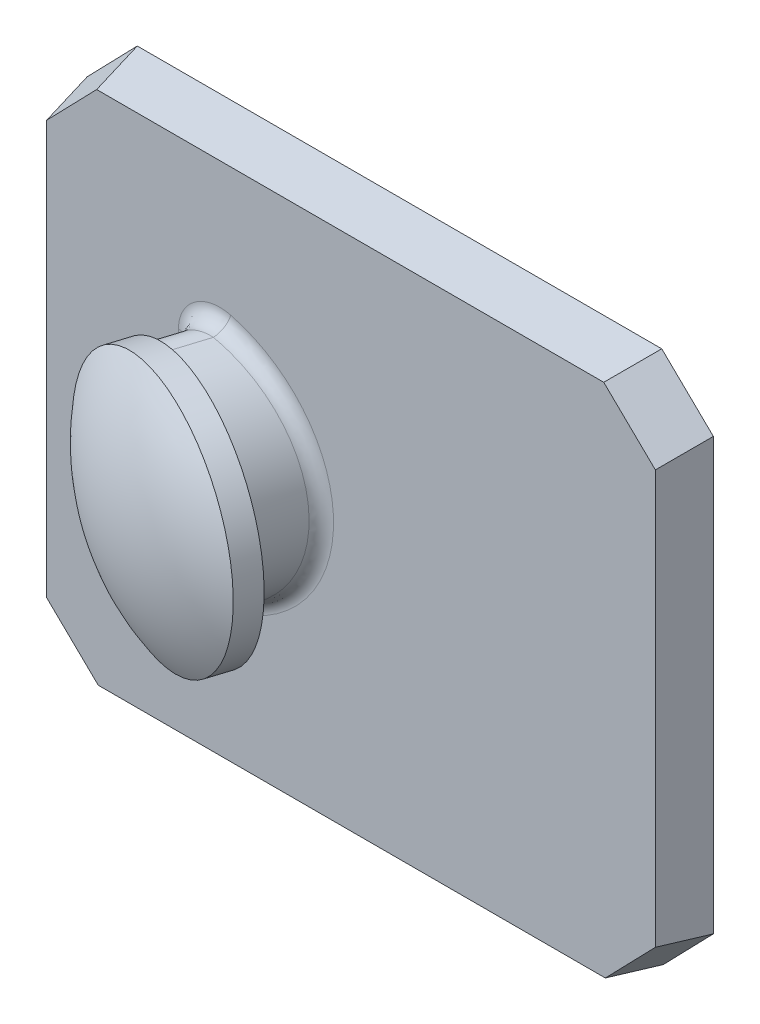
ISO-10303-21;
HEADER;
FILE_DESCRIPTION(('STEP AP214'),'2;1');
FILE_NAME('part.step','',(''),(''),'','','');
FILE_SCHEMA(('AUTOMOTIVE_DESIGN { 1 0 10303 214 1 1 1 1 }'));
ENDSEC;
DATA;
#1=APPLICATION_CONTEXT('core data for automotive mechanical design processes');
#2=APPLICATION_PROTOCOL_DEFINITION('international standard','automotive_design',2000,#1);
#3=PRODUCT_CONTEXT('',#1,'mechanical');
#4=PRODUCT('Part','Part','',(#3));
#5=PRODUCT_RELATED_PRODUCT_CATEGORY('part','',(#4));
#6=PRODUCT_DEFINITION_FORMATION('','',#4);
#7=PRODUCT_DEFINITION_CONTEXT('part definition',#1,'design');
#8=PRODUCT_DEFINITION('design','',#6,#7);
#9=PRODUCT_DEFINITION_SHAPE('','',#8);
#10=(LENGTH_UNIT() NAMED_UNIT(*) SI_UNIT(.MILLI.,.METRE.));
#11=(NAMED_UNIT(*) PLANE_ANGLE_UNIT() SI_UNIT($,.RADIAN.));
#12=(NAMED_UNIT(*) SI_UNIT($,.STERADIAN.) SOLID_ANGLE_UNIT());
#13=UNCERTAINTY_MEASURE_WITH_UNIT(LENGTH_MEASURE(1.E-05),#10,'distance_accuracy_value','');
#14=(GEOMETRIC_REPRESENTATION_CONTEXT(3) GLOBAL_UNCERTAINTY_ASSIGNED_CONTEXT((#13)) GLOBAL_UNIT_ASSIGNED_CONTEXT((#10,
#11,#12)) REPRESENTATION_CONTEXT('',''));
#15=CARTESIAN_POINT('',(0.,0.,0.));
#16=DIRECTION('',(0.,0.,1.));
#17=DIRECTION('',(1.,0.,0.));
#18=AXIS2_PLACEMENT_3D('',#15,#16,#17);
#19=CARTESIAN_POINT('',(157632.816425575,1.84817223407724,-500000.039540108));
#20=DIRECTION('',(-0.300504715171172,0.,0.953780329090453));
#21=DIRECTION('',(0.953780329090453,0.,0.300504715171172));
#22=AXIS2_PLACEMENT_3D('',#19,#20,#21);
#23=CYLINDRICAL_SURFACE('',#22,0.500000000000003);
#24=DIRECTION('',(-0.300504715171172,0.,0.953780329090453));
#25=VECTOR('',#24,1.);
#26=CARTESIAN_POINT('',(157632.94192303,2.33054861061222,-500000.));
#27=LINE('',#26,#25);
#28=CARTESIAN_POINT('',(99.035498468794,2.33054861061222,1.27627593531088));
#29=VERTEX_POINT('',#28);
#30=CARTESIAN_POINT('',(98.8079545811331,2.33054861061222,1.99848385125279));
#31=VERTEX_POINT('',#30);
#32=EDGE_CURVE('E134',#29,#31,#27,.T.);
#33=ORIENTED_EDGE('',*,*,#32,.F.);
#34=CARTESIAN_POINT('',(98.8900685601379,1.84817223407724,1.30000000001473));
#35=DIRECTION('',(0.161002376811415,0.,0.986954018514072));
#36=DIRECTION('',(-0.986954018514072,0.,0.161002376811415));
#37=AXIS2_PLACEMENT_3D('',#34,#35,#36);
#38=ELLIPSE('',#37,0.559938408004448,0.500000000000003);
#39=CARTESIAN_POINT('',(98.3374350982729,1.84817223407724,1.39015141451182));
#40=VERTEX_POINT('',#39);
#41=EDGE_CURVE('E202',#29,#40,#38,.T.);
#42=ORIENTED_EDGE('',*,*,#41,.T.);
#43=DIRECTION('',(-0.300504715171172,0.,0.953780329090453));
#44=VECTOR('',#43,1.);
#45=CARTESIAN_POINT('',(157632.33953541,1.84817223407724,-500000.189792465));
#46=LINE('',#45,#44);
#47=CARTESIAN_POINT('',(98.2055670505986,1.84817223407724,1.80869110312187));
#48=VERTEX_POINT('',#47);
#49=EDGE_CURVE('E161',#40,#48,#46,.T.);
#50=ORIENTED_EDGE('',*,*,#49,.T.);
#51=CARTESIAN_POINT('',(98.6824571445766,1.84817223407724,1.95894368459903));
#52=DIRECTION('',(-0.30050516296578,0.,0.95378018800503));
#53=DIRECTION('',(0.95378018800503,0.,0.30050516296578));
#54=AXIS2_PLACEMENT_3D('',#51,#52,#53);
#55=CIRCLE('',#54,0.500000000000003);
#56=EDGE_CURVE('E153',#48,#31,#55,.F.);
#57=ORIENTED_EDGE('',*,*,#56,.T.);
#58=EDGE_LOOP('',(#33,#42,#50,#57));
#59=FACE_BOUND('',#58,.T.);
#60=ADVANCED_FACE('F32',(#59),#23,.T.);
#61=CARTESIAN_POINT('',(157632.33953541,1.84817223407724,-500000.189792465));
#62=DIRECTION('',(-0.953780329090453,0.,-0.300504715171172));
#63=DIRECTION('',(-0.300504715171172,0.,0.953780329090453));
#64=AXIS2_PLACEMENT_3D('',#61,#62,#63);
#65=PLANE('',#64);
#66=ORIENTED_EDGE('',*,*,#49,.F.);
#67=DIRECTION('',(0.,-1.,0.));
#68=VECTOR('',#67,1.);
#69=CARTESIAN_POINT('',(98.3374350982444,1.84817223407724,1.39015141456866));
#70=LINE('',#69,#68);
#71=CARTESIAN_POINT('',(98.3374350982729,-1.81788696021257,1.39015141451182));
#72=VERTEX_POINT('',#71);
#73=EDGE_CURVE('E204',#40,#72,#70,.T.);
#74=ORIENTED_EDGE('',*,*,#73,.T.);
#75=DIRECTION('',(-0.300504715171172,0.,0.953780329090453));
#76=VECTOR('',#75,1.);
#77=CARTESIAN_POINT('',(157632.33953541,-1.81788696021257,-500000.189792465));
#78=LINE('',#77,#76);
#79=CARTESIAN_POINT('',(98.205567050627,-1.81788696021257,1.80869110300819));
#80=VERTEX_POINT('',#79);
#81=EDGE_CURVE('E164',#72,#80,#78,.T.);
#82=ORIENTED_EDGE('',*,*,#81,.T.);
#83=DIRECTION('',(0.,1.,0.));
#84=VECTOR('',#83,1.);
#85=CARTESIAN_POINT('',(98.2055670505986,1.84817223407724,1.80869110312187));
#86=LINE('',#85,#84);
#87=EDGE_CURVE('E162',#80,#48,#86,.T.);
#88=ORIENTED_EDGE('',*,*,#87,.T.);
#89=EDGE_LOOP('',(#66,#74,#82,#88));
#90=FACE_BOUND('',#89,.T.);
#91=ADVANCED_FACE('F320',(#90),#65,.T.);
#92=CARTESIAN_POINT('',(157632.816425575,-1.81788696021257,-500000.039540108));
#93=DIRECTION('',(-0.300504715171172,0.,0.953780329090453));
#94=DIRECTION('',(0.953780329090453,0.,0.300504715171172));
#95=AXIS2_PLACEMENT_3D('',#92,#93,#94);
#96=CYLINDRICAL_SURFACE('',#95,0.500000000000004);
#97=ORIENTED_EDGE('',*,*,#81,.F.);
#98=CARTESIAN_POINT('',(98.8900685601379,-1.81788696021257,1.30000000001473));
#99=DIRECTION('',(0.161002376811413,0.,0.986954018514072));
#100=DIRECTION('',(-0.986954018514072,0.,0.161002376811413));
#101=AXIS2_PLACEMENT_3D('',#98,#99,#100);
#102=ELLIPSE('',#101,0.559938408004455,0.500000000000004);
#103=CARTESIAN_POINT('',(99.0354984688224,-2.30026333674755,1.27627593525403));
#104=VERTEX_POINT('',#103);
#105=EDGE_CURVE('E157',#72,#104,#102,.T.);
#106=ORIENTED_EDGE('',*,*,#105,.T.);
#107=DIRECTION('',(-0.300504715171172,0.,0.953780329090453));
#108=VECTOR('',#107,1.);
#109=CARTESIAN_POINT('',(157632.94192303,-2.30026333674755,-500000.));
#110=LINE('',#109,#108);
#111=CARTESIAN_POINT('',(98.8079545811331,-2.30026333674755,1.99848385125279));
#112=VERTEX_POINT('',#111);
#113=EDGE_CURVE('E145',#104,#112,#110,.T.);
#114=ORIENTED_EDGE('',*,*,#113,.T.);
#115=CARTESIAN_POINT('',(98.6824571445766,-1.81788696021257,1.95894368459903));
#116=DIRECTION('',(-0.30050516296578,0.,0.95378018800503));
#117=DIRECTION('',(0.95378018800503,0.,0.30050516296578));
#118=AXIS2_PLACEMENT_3D('',#115,#116,#117);
#119=CIRCLE('',#118,0.500000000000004);
#120=EDGE_CURVE('E156',#112,#80,#119,.F.);
#121=ORIENTED_EDGE('',*,*,#120,.T.);
#122=EDGE_LOOP('',(#97,#106,#114,#121));
#123=FACE_BOUND('',#122,.T.);
#124=ADVANCED_FACE('F229',(#123),#96,.T.);
#125=CARTESIAN_POINT('',(157632.33953541,0.0151426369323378,-500000.189792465));
#126=DIRECTION('',(-0.300504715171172,0.,0.953780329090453));
#127=DIRECTION('',(0.953780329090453,0.,0.300504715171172));
#128=AXIS2_PLACEMENT_3D('',#125,#126,#127);
#129=CYLINDRICAL_SURFACE('',#128,2.39999934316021);
#130=ORIENTED_EDGE('',*,*,#113,.F.);
#131=CARTESIAN_POINT('',(98.3658388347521,0.0151426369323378,1.30000000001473));
#132=DIRECTION('',(0.0354048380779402,0.,0.999373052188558));
#133=DIRECTION('',(-0.999373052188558,0.,0.0354048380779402));
#134=AXIS2_PLACEMENT_3D('',#131,#132,#133);
#135=ELLIPSE('',#134,2.54630212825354,2.39999934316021);
#136=EDGE_CURVE('E140',#104,#29,#135,.T.);
#137=ORIENTED_EDGE('',*,*,#136,.T.);
#138=ORIENTED_EDGE('',*,*,#32,.T.);
#139=CARTESIAN_POINT('',(98.2055670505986,0.0151426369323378,1.80869110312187));
#140=DIRECTION('',(-0.30050516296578,0.,0.95378018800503));
#141=DIRECTION('',(0.95378018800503,0.,0.30050516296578));
#142=AXIS2_PLACEMENT_3D('',#139,#140,#141);
#143=CIRCLE('',#142,2.39999934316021);
#144=EDGE_CURVE('E138',#31,#112,#143,.F.);
#145=ORIENTED_EDGE('',*,*,#144,.T.);
#146=EDGE_LOOP('',(#130,#137,#138,#145));
#147=FACE_BOUND('',#146,.T.);
#148=ADVANCED_FACE('F137',(#147),#129,.T.);
#149=CARTESIAN_POINT('',(95.201,-5.4,0.));
#150=DIRECTION('',(-0.984807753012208,0.,0.173648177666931));
#151=DIRECTION('',(0.173648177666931,0.,0.984807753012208));
#152=AXIS2_PLACEMENT_3D('',#149,#150,#151);
#153=PLANE('',#152);
#154=DIRECTION('',(0.,1.,0.));
#155=VECTOR('',#154,1.);
#156=CARTESIAN_POINT('',(95.3773269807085,-5.4,1.));
#157=LINE('',#156,#155);
#158=CARTESIAN_POINT('',(95.3773269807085,4.17666076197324,1.));
#159=VERTEX_POINT('',#158);
#160=CARTESIAN_POINT('',(95.3773269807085,-4.20870814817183,1.));
#161=VERTEX_POINT('',#160);
#162=EDGE_CURVE('E181',#159,#161,#157,.F.);
#163=ORIENTED_EDGE('',*,*,#162,.F.);
#164=DIRECTION('',(0.171087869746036,-0.171087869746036,0.970287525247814));
#165=VECTOR('',#164,1.);
#166=CARTESIAN_POINT('',(95.4864802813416,4.06750746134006,1.61903912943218));
#167=LINE('',#166,#165);
#168=CARTESIAN_POINT('',(95.201,4.3529877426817,0.));
#169=VERTEX_POINT('',#168);
#170=EDGE_CURVE('E259',#159,#169,#167,.F.);
#171=ORIENTED_EDGE('',*,*,#170,.T.);
#172=DIRECTION('',(0.,-1.,0.));
#173=VECTOR('',#172,1.);
#174=CARTESIAN_POINT('',(95.201,-5.4,0.));
#175=LINE('',#174,#173);
#176=CARTESIAN_POINT('',(95.201,-4.3850351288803,0.));
#177=VERTEX_POINT('',#176);
#178=EDGE_CURVE('E144',#169,#177,#175,.T.);
#179=ORIENTED_EDGE('',*,*,#178,.T.);
#180=DIRECTION('',(-0.171087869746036,-0.171087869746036,-0.970287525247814));
#181=VECTOR('',#180,1.);
#182=CARTESIAN_POINT('',(95.1712909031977,-4.41474422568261,-0.168488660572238));
#183=LINE('',#182,#181);
#184=EDGE_CURVE('E206',#177,#161,#183,.F.);
#185=ORIENTED_EDGE('',*,*,#184,.T.);
#186=EDGE_LOOP('',(#163,#171,#179,#185));
#187=FACE_BOUND('',#186,.T.);
#188=ADVANCED_FACE('F313',(#187),#153,.T.);
#189=CARTESIAN_POINT('',(95.201,-5.4,0.));
#190=DIRECTION('',(0.,-0.984807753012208,0.173648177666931));
#191=DIRECTION('',(0.,-0.173648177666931,-0.984807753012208));
#192=AXIS2_PLACEMENT_3D('',#189,#190,#191);
#193=PLANE('',#192);
#194=DIRECTION('',(1.,0.,0.));
#195=VECTOR('',#194,1.);
#196=CARTESIAN_POINT('',(95.201,-5.4,0.));
#197=LINE('',#196,#195);
#198=CARTESIAN_POINT('',(96.2480122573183,-5.4,0.));
#199=VERTEX_POINT('',#198);
#200=CARTESIAN_POINT('',(106.88503512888,-5.4,0.));
#201=VERTEX_POINT('',#200);
#202=EDGE_CURVE('E173',#199,#201,#197,.T.);
#203=ORIENTED_EDGE('',*,*,#202,.T.);
#204=DIRECTION('',(0.171087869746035,-0.171087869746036,-0.970287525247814));
#205=VECTOR('',#204,1.);
#206=CARTESIAN_POINT('',(106.543031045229,-5.05799591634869,1.9396015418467));
#207=LINE('',#206,#205);
#208=CARTESIAN_POINT('',(106.708708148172,-5.22367301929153,1.));
#209=VERTEX_POINT('',#208);
#210=EDGE_CURVE('E11',#201,#209,#207,.F.);
#211=ORIENTED_EDGE('',*,*,#210,.T.);
#212=DIRECTION('',(-1.,0.,0.));
#213=VECTOR('',#212,1.);
#214=CARTESIAN_POINT('',(95.201,-5.22367301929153,1.));
#215=LINE('',#214,#213);
#216=CARTESIAN_POINT('',(96.4243392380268,-5.22367301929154,1.));
#217=VERTEX_POINT('',#216);
#218=EDGE_CURVE('E184',#217,#209,#215,.F.);
#219=ORIENTED_EDGE('',*,*,#218,.F.);
#220=DIRECTION('',(0.171087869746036,0.171087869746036,0.970287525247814));
#221=VECTOR('',#220,1.);
#222=CARTESIAN_POINT('',(96.2173650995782,-5.43064715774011,-0.173808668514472));
#223=LINE('',#222,#221);
#224=EDGE_CURVE('E40',#217,#199,#223,.F.);
#225=ORIENTED_EDGE('',*,*,#224,.T.);
#226=EDGE_LOOP('',(#203,#211,#219,#225));
#227=FACE_BOUND('',#226,.T.);
#228=ADVANCED_FACE('F225',(#227),#193,.T.);
#229=CARTESIAN_POINT('',(107.9,-5.4,0.));
#230=DIRECTION('',(0.984807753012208,0.,0.173648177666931));
#231=DIRECTION('',(0.173648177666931,0.,-0.984807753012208));
#232=AXIS2_PLACEMENT_3D('',#229,#230,#231);
#233=PLANE('',#232);
#234=DIRECTION('',(0.,1.,0.));
#235=VECTOR('',#234,1.);
#236=CARTESIAN_POINT('',(107.9,-5.4,0.));
#237=LINE('',#236,#235);
#238=CARTESIAN_POINT('',(107.9,-4.35298774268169,0.));
#239=VERTEX_POINT('',#238);
#240=CARTESIAN_POINT('',(107.9,4.38503512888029,0.));
#241=VERTEX_POINT('',#240);
#242=EDGE_CURVE('E176',#239,#241,#237,.T.);
#243=ORIENTED_EDGE('',*,*,#242,.T.);
#244=DIRECTION('',(0.171087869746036,0.171087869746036,-0.970287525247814));
#245=VECTOR('',#244,1.);
#246=CARTESIAN_POINT('',(107.613581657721,4.09861678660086,1.62435913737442));
#247=LINE('',#246,#245);
#248=CARTESIAN_POINT('',(107.723673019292,4.20870814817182,1.));
#249=VERTEX_POINT('',#248);
#250=EDGE_CURVE('E47',#241,#249,#247,.F.);
#251=ORIENTED_EDGE('',*,*,#250,.T.);
#252=DIRECTION('',(0.,-1.,0.));
#253=VECTOR('',#252,1.);
#254=CARTESIAN_POINT('',(107.723673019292,-5.40000000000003,1.));
#255=LINE('',#254,#253);
#256=CARTESIAN_POINT('',(107.723673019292,-4.17666076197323,1.));
#257=VERTEX_POINT('',#256);
#258=EDGE_CURVE('E186',#257,#249,#255,.F.);
#259=ORIENTED_EDGE('',*,*,#258,.F.);
#260=DIRECTION('',(-0.171087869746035,0.171087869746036,0.970287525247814));
#261=VECTOR('',#260,1.);
#262=CARTESIAN_POINT('',(107.93064715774,-4.38363490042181,-0.17380866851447));
#263=LINE('',#262,#261);
#264=EDGE_CURVE('E282',#257,#239,#263,.F.);
#265=ORIENTED_EDGE('',*,*,#264,.T.);
#266=EDGE_LOOP('',(#243,#251,#259,#265));
#267=FACE_BOUND('',#266,.T.);
#268=ADVANCED_FACE('F299',(#267),#233,.T.);
#269=CARTESIAN_POINT('',(95.201,5.4,0.));
#270=DIRECTION('',(0.,0.984807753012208,0.173648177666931));
#271=DIRECTION('',(0.,-0.173648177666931,0.984807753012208));
#272=AXIS2_PLACEMENT_3D('',#269,#270,#271);
#273=PLANE('',#272);
#274=DIRECTION('',(-1.,0.,0.));
#275=VECTOR('',#274,1.);
#276=CARTESIAN_POINT('',(95.201,5.4,0.));
#277=LINE('',#276,#275);
#278=CARTESIAN_POINT('',(106.852987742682,5.4,0.));
#279=VERTEX_POINT('',#278);
#280=CARTESIAN_POINT('',(96.2159648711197,5.4,0.));
#281=VERTEX_POINT('',#280);
#282=EDGE_CURVE('E178',#279,#281,#277,.T.);
#283=ORIENTED_EDGE('',*,*,#282,.T.);
#284=DIRECTION('',(-0.171087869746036,0.171087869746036,-0.970287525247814));
#285=VECTOR('',#284,1.);
#286=CARTESIAN_POINT('',(96.1862557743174,5.42970909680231,-0.168488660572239));
#287=LINE('',#286,#285);
#288=CARTESIAN_POINT('',(96.3922918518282,5.22367301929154,1.));
#289=VERTEX_POINT('',#288);
#290=EDGE_CURVE('E273',#281,#289,#287,.F.);
#291=ORIENTED_EDGE('',*,*,#290,.T.);
#292=DIRECTION('',(1.,0.,0.));
#293=VECTOR('',#292,1.);
#294=CARTESIAN_POINT('',(95.201,5.22367301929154,1.));
#295=LINE('',#294,#293);
#296=CARTESIAN_POINT('',(106.676660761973,5.22367301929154,1.));
#297=VERTEX_POINT('',#296);
#298=EDGE_CURVE('E158',#297,#289,#295,.F.);
#299=ORIENTED_EDGE('',*,*,#298,.F.);
#300=DIRECTION('',(-0.171087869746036,-0.171087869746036,0.970287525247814));
#301=VECTOR('',#300,1.);
#302=CARTESIAN_POINT('',(106.511921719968,5.05893397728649,1.93428153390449));
#303=LINE('',#302,#301);
#304=EDGE_CURVE('E270',#297,#279,#303,.F.);
#305=ORIENTED_EDGE('',*,*,#304,.T.);
#306=EDGE_LOOP('',(#283,#291,#299,#305));
#307=FACE_BOUND('',#306,.T.);
#308=ADVANCED_FACE('F237',(#307),#273,.T.);
#309=CARTESIAN_POINT('',(95.201,-5.4,1.));
#310=DIRECTION('',(0.,0.,-1.));
#311=DIRECTION('',(-1.,0.,0.));
#312=AXIS2_PLACEMENT_3D('',#309,#310,#311);
#313=PLANE('',#312);
#314=CARTESIAN_POINT('',(98.3658388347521,0.0151426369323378,1.00000000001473));
#315=DIRECTION('',(0.,0.,-1.));
#316=DIRECTION('',(-1.,0.,0.));
#317=AXIS2_PLACEMENT_3D('',#314,#315,#316);
#318=ELLIPSE('',#317,2.83083982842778,2.69999934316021);
#319=CARTESIAN_POINT('',(99.1107969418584,2.61997443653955,1.));
#320=VERTEX_POINT('',#319);
#321=CARTESIAN_POINT('',(99.110796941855,-2.58968916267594,1.));
#322=VERTEX_POINT('',#321);
#323=EDGE_CURVE('E196',#320,#322,#318,.T.);
#324=ORIENTED_EDGE('',*,*,#323,.T.);
#325=CARTESIAN_POINT('',(98.8900685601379,-1.81788696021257,1.00000000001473));
#326=DIRECTION('',(0.,0.,-1.));
#327=DIRECTION('',(-1.,0.,0.));
#328=AXIS2_PLACEMENT_3D('',#325,#326,#327);
#329=ELLIPSE('',#328,0.838767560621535,0.800000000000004);
#330=CARTESIAN_POINT('',(98.051300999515,-1.81788696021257,1.));
#331=VERTEX_POINT('',#330);
#332=EDGE_CURVE('E198',#322,#331,#329,.T.);
#333=ORIENTED_EDGE('',*,*,#332,.T.);
#334=DIRECTION('',(0.,-1.,0.));
#335=VECTOR('',#334,1.);
#336=CARTESIAN_POINT('',(98.051300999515,-5.4,1.));
#337=LINE('',#336,#335);
#338=CARTESIAN_POINT('',(98.051300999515,1.84817223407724,1.));
#339=VERTEX_POINT('',#338);
#340=EDGE_CURVE('E192',#331,#339,#337,.F.);
#341=ORIENTED_EDGE('',*,*,#340,.T.);
#342=CARTESIAN_POINT('',(98.8900685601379,1.84817223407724,1.00000000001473));
#343=DIRECTION('',(0.,0.,-1.));
#344=DIRECTION('',(-1.,0.,0.));
#345=AXIS2_PLACEMENT_3D('',#342,#343,#344);
#346=ELLIPSE('',#345,0.838767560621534,0.800000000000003);
#347=EDGE_CURVE('E194',#339,#320,#346,.T.);
#348=ORIENTED_EDGE('',*,*,#347,.T.);
#349=EDGE_LOOP('',(#324,#333,#341,#348));
#350=FACE_BOUND('',#349,.T.);
#351=ORIENTED_EDGE('',*,*,#298,.T.);
#352=DIRECTION('',(0.69603282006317,0.718009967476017,0.));
#353=VECTOR('',#352,1.);
#354=CARTESIAN_POINT('',(95.3756572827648,4.17493834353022,1.));
#355=LINE('',#354,#353);
#356=EDGE_CURVE('E280',#289,#159,#355,.F.);
#357=ORIENTED_EDGE('',*,*,#356,.T.);
#358=ORIENTED_EDGE('',*,*,#162,.T.);
#359=DIRECTION('',(-0.718009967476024,0.696032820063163,0.));
#360=VECTOR('',#359,1.);
#361=CARTESIAN_POINT('',(96.4210732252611,-5.22050697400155,1.));
#362=LINE('',#361,#360);
#363=EDGE_CURVE('E275',#161,#217,#362,.F.);
#364=ORIENTED_EDGE('',*,*,#363,.T.);
#365=ORIENTED_EDGE('',*,*,#218,.T.);
#366=DIRECTION('',(-0.696032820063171,-0.718009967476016,0.));
#367=VECTOR('',#366,1.);
#368=CARTESIAN_POINT('',(107.720506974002,-4.17992677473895,1.));
#369=LINE('',#368,#367);
#370=EDGE_CURVE('E54',#209,#257,#369,.F.);
#371=ORIENTED_EDGE('',*,*,#370,.T.);
#372=ORIENTED_EDGE('',*,*,#258,.T.);
#373=DIRECTION('',(0.718009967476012,-0.696032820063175,0.));
#374=VECTOR('',#373,1.);
#375=CARTESIAN_POINT('',(106.674061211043,5.2261930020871,1.));
#376=LINE('',#375,#374);
#377=EDGE_CURVE('E278',#249,#297,#376,.F.);
#378=ORIENTED_EDGE('',*,*,#377,.T.);
#379=EDGE_LOOP('',(#351,#357,#358,#364,#365,#371,#372,#378));
#380=FACE_BOUND('',#379,.T.);
#381=ADVANCED_FACE('F232',(#350,#380),#313,.F.);
#382=CARTESIAN_POINT('',(95.201,-5.4,0.));
#383=DIRECTION('',(0.,0.,-1.));
#384=DIRECTION('',(-1.,0.,0.));
#385=AXIS2_PLACEMENT_3D('',#382,#383,#384);
#386=PLANE('',#385);
#387=ORIENTED_EDGE('',*,*,#178,.F.);
#388=DIRECTION('',(-0.69603282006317,-0.718009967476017,0.));
#389=VECTOR('',#388,1.);
#390=CARTESIAN_POINT('',(90.3268614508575,-0.675051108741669,0.));
#391=LINE('',#390,#389);
#392=EDGE_CURVE('E268',#169,#281,#391,.F.);
#393=ORIENTED_EDGE('',*,*,#392,.T.);
#394=ORIENTED_EDGE('',*,*,#282,.F.);
#395=DIRECTION('',(-0.718009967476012,0.696032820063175,0.));
#396=VECTOR('',#395,1.);
#397=CARTESIAN_POINT('',(106.243333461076,5.99099373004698,0.));
#398=LINE('',#397,#396);
#399=EDGE_CURVE('E266',#279,#241,#398,.F.);
#400=ORIENTED_EDGE('',*,*,#399,.T.);
#401=ORIENTED_EDGE('',*,*,#242,.F.);
#402=DIRECTION('',(0.696032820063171,0.718009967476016,0.));
#403=VECTOR('',#402,1.);
#404=CARTESIAN_POINT('',(101.22456776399,-11.2391958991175,0.));
#405=LINE('',#404,#403);
#406=EDGE_CURVE('E264',#239,#201,#405,.F.);
#407=ORIENTED_EDGE('',*,*,#406,.T.);
#408=ORIENTED_EDGE('',*,*,#202,.F.);
#409=DIRECTION('',(0.718009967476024,-0.696032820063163,0.));
#410=VECTOR('',#409,1.);
#411=CARTESIAN_POINT('',(95.7082373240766,-4.87674672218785,0.));
#412=LINE('',#411,#410);
#413=EDGE_CURVE('E262',#199,#177,#412,.F.);
#414=ORIENTED_EDGE('',*,*,#413,.T.);
#415=EDGE_LOOP('',(#387,#393,#394,#400,#401,#407,#408,#414));
#416=FACE_BOUND('',#415,.T.);
#417=ADVANCED_FACE('F236',(#416),#386,.T.);
#418=CARTESIAN_POINT('',(100.297489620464,0.,-0.971492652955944));
#419=DIRECTION('',(0.30050516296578,0.,-0.95378018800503));
#420=DIRECTION('',(-0.95378018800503,0.,-0.30050516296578));
#421=AXIS2_PLACEMENT_3D('',#418,#419,#420);
#422=SPHERICAL_SURFACE('',#421,4.53273071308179);
#423=CARTESIAN_POINT('',(99.1615831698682,0.,2.63378672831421));
#424=DIRECTION('',(0.30050516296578,0.,-0.95378018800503));
#425=DIRECTION('',(-0.95378018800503,0.,-0.30050516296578));
#426=AXIS2_PLACEMENT_3D('',#423,#424,#425);
#427=CIRCLE('',#426,2.50146453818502);
#428=CARTESIAN_POINT('',(96.7757358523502,0.,1.8820837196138));
#429=VERTEX_POINT('',#428);
#430=EDGE_CURVE('E346',#429,#429,#427,.T.);
#431=ORIENTED_EDGE('',*,*,#430,.F.);
#432=EDGE_LOOP('',(#431));
#433=FACE_BOUND('',#432,.T.);
#434=ADVANCED_FACE('F330',(#433),#422,.T.);
#435=CARTESIAN_POINT('',(99.3117372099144,0.,2.15720939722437));
#436=DIRECTION('',(-0.30050516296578,0.,0.95378018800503));
#437=DIRECTION('',(0.95378018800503,0.,0.30050516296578));
#438=AXIS2_PLACEMENT_3D('',#435,#436,#437);
#439=PLANE('',#438);
#440=ORIENTED_EDGE('',*,*,#56,.F.);
#441=ORIENTED_EDGE('',*,*,#87,.F.);
#442=ORIENTED_EDGE('',*,*,#120,.F.);
#443=ORIENTED_EDGE('',*,*,#144,.F.);
#444=EDGE_LOOP('',(#440,#441,#442,#443));
#445=FACE_BOUND('',#444,.T.);
#446=CARTESIAN_POINT('',(99.3117372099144,0.,2.15720939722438));
#447=DIRECTION('',(0.30050516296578,0.,-0.95378018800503));
#448=DIRECTION('',(-0.95378018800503,0.,-0.30050516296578));
#449=AXIS2_PLACEMENT_3D('',#446,#447,#448);
#450=CIRCLE('',#449,2.50146453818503);
#451=CARTESIAN_POINT('',(96.9258898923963,0.,1.40550638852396));
#452=VERTEX_POINT('',#451);
#453=EDGE_CURVE('E343',#452,#452,#450,.T.);
#454=ORIENTED_EDGE('',*,*,#453,.T.);
#455=EDGE_LOOP('',(#454));
#456=FACE_BOUND('',#455,.T.);
#457=ADVANCED_FACE('F150',(#445,#456),#439,.F.);
#458=CARTESIAN_POINT('',(99.5883555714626,0.,1.27924407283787));
#459=DIRECTION('',(0.30050516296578,0.,-0.95378018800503));
#460=DIRECTION('',(-0.95378018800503,0.,-0.30050516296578));
#461=AXIS2_PLACEMENT_3D('',#458,#459,#460);
#462=CYLINDRICAL_SURFACE('',#461,2.50146453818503);
#463=ORIENTED_EDGE('',*,*,#453,.F.);
#464=EDGE_LOOP('',(#463));
#465=FACE_BOUND('',#464,.T.);
#466=ORIENTED_EDGE('',*,*,#430,.T.);
#467=EDGE_LOOP('',(#466));
#468=FACE_BOUND('',#467,.T.);
#469=ADVANCED_FACE('F249',(#465,#468),#462,.T.);
#470=CARTESIAN_POINT('',(98.0513009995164,1.84817223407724,1.));
#471=CARTESIAN_POINT('',(98.4603589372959,1.84817223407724,1.00000000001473));
#472=CARTESIAN_POINT('',(98.3374350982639,1.84817223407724,1.39015141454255));
#473=CARTESIAN_POINT('',(98.0513009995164,1.88308856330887,1.));
#474=CARTESIAN_POINT('',(98.4603589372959,1.86437034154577,1.00000000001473));
#475=CARTESIAN_POINT('',(98.3374350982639,1.86999493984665,1.39015141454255));
#476=CARTESIAN_POINT('',(98.0537024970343,1.91800489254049,1.));
#477=CARTESIAN_POINT('',(98.4610781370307,1.88054851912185,1.00000000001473));
#478=CARTESIAN_POINT('',(98.3390173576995,1.89181764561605,1.38989329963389));
#479=CARTESIAN_POINT('',(98.0632590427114,1.98723940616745,1.));
#480=CARTESIAN_POINT('',(98.4640208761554,1.91307507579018,1.00000000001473));
#481=CARTESIAN_POINT('',(98.345313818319,1.93508921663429,1.38886615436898));
#482=CARTESIAN_POINT('',(98.07042204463,2.02155649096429,1.));
#483=CARTESIAN_POINT('',(98.4662397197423,1.92938412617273,1.00000000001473));
#484=CARTESIAN_POINT('',(98.3500332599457,1.95653739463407,1.38809626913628));
#485=CARTESIAN_POINT('',(98.0893710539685,2.08900693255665,1.));
#486=CARTESIAN_POINT('',(98.4723564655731,1.96224301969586,1.00000000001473));
#487=CARTESIAN_POINT('',(98.3625180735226,1.99869392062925,1.38605961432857));
#488=CARTESIAN_POINT('',(98.1011718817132,2.12213611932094,1.));
#489=CARTESIAN_POINT('',(98.4762448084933,1.97875522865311,1.00000000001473));
#490=CARTESIAN_POINT('',(98.3702932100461,2.01939966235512,1.38479125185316));
#491=CARTESIAN_POINT('',(98.1291881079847,2.18664744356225,1.));
#492=CARTESIAN_POINT('',(98.4859462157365,2.01198564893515,1.00000000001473));
#493=CARTESIAN_POINT('',(98.3887520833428,2.05971924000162,1.38178004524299));
#494=CARTESIAN_POINT('',(98.1454232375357,2.21802099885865,1.));
#495=CARTESIAN_POINT('',(98.4917446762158,2.02866933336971,1.00000000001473));
#496=CARTESIAN_POINT('',(98.3994488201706,2.07932771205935,1.3800350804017));
#497=CARTESIAN_POINT('',(98.18202602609,2.27848895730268,1.));
#498=CARTESIAN_POINT('',(98.5055307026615,2.06207899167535,1.00000000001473));
#499=CARTESIAN_POINT('',(98.4235650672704,2.11712018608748,1.37610098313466));
#500=CARTESIAN_POINT('',(98.2024158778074,2.30756990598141,1.));
#501=CARTESIAN_POINT('',(98.5134986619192,2.0787752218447,1.00000000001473));
#502=CARTESIAN_POINT('',(98.4369991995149,2.13529577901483,1.37390946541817));
#503=CARTESIAN_POINT('',(98.2469776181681,2.36295999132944,1.));
#504=CARTESIAN_POINT('',(98.5318523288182,2.11191834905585,1.00000000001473));
#505=CARTESIAN_POINT('',(98.4663593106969,2.16991458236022,1.3691199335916));
#506=CARTESIAN_POINT('',(98.2711716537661,2.38925128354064,1.));
#507=CARTESIAN_POINT('',(98.5422139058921,2.12834209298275,1.00000000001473));
#508=CARTESIAN_POINT('',(98.4822998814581,2.18634663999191,1.36651953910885));
#509=CARTESIAN_POINT('',(98.3229287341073,2.4386163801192,1.));
#510=CARTESIAN_POINT('',(98.5655015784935,2.1605426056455,1.00000000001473));
#511=CARTESIAN_POINT('',(98.5164007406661,2.21719982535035,1.3609566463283));
#512=CARTESIAN_POINT('',(98.3505117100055,2.46166925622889,1.));
#513=CARTESIAN_POINT('',(98.5784000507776,2.17630452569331,1.00000000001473));
#514=CARTESIAN_POINT('',(98.5345741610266,2.23160787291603,1.3579920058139));
#515=CARTESIAN_POINT('',(98.4085777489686,2.50416571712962,1.));
#516=CARTESIAN_POINT('',(98.6067950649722,2.20671312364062,1.00000000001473));
#517=CARTESIAN_POINT('',(98.5728317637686,2.2581681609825,1.3517510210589));
#518=CARTESIAN_POINT('',(98.4390769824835,2.52358717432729,1.));
#519=CARTESIAN_POINT('',(98.622262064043,2.22135463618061,1.00000000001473));
#520=CARTESIAN_POINT('',(98.5929266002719,2.27030657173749,1.34847293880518));
#521=CARTESIAN_POINT('',(98.5024580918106,2.55848908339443,1.));
#522=CARTESIAN_POINT('',(98.655699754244,2.24902428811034,1.00000000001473));
#523=CARTESIAN_POINT('',(98.6346861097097,2.29212026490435,1.34166068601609));
#524=CARTESIAN_POINT('',(98.5353516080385,2.57394836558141,1.));
#525=CARTESIAN_POINT('',(98.6736409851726,2.26205779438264,1.00000000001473));
#526=CARTESIAN_POINT('',(98.6563584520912,2.30178231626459,1.33812526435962));
#527=CARTESIAN_POINT('',(98.6029634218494,2.60065977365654,1.));
#528=CARTESIAN_POINT('',(98.7118050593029,2.28602284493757,1.00000000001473));
#529=CARTESIAN_POINT('',(98.7009054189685,2.3184769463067,1.33085829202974));
#530=CARTESIAN_POINT('',(98.637688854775,2.61189381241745,1.));
#531=CARTESIAN_POINT('',(98.7320007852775,2.29697048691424,1.00000000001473));
#532=CARTESIAN_POINT('',(98.7237847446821,2.32549822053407,1.32712597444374));
#533=CARTESIAN_POINT('',(98.7083750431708,2.62995876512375,1.));
#534=CARTESIAN_POINT('',(98.7743356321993,2.3163184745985,1.00000000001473));
#535=CARTESIAN_POINT('',(98.7703573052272,2.33678881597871,1.31952856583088));
#536=CARTESIAN_POINT('',(98.7443391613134,2.63677650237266,1.));
#537=CARTESIAN_POINT('',(98.7964523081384,2.32474514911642,1.00000000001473));
#538=CARTESIAN_POINT('',(98.7940527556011,2.34104990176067,1.31566311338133));
#539=CARTESIAN_POINT('',(98.8168911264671,2.64588670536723,1.));
#540=CARTESIAN_POINT('',(98.8421935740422,2.33867513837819,1.00000000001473));
#541=CARTESIAN_POINT('',(98.8418546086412,2.34674377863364,1.30786516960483));
#542=CARTESIAN_POINT('',(98.8534798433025,2.64817223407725,1.));
#543=CARTESIAN_POINT('',(98.8658026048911,2.34421382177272,1.00000000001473));
#544=CARTESIAN_POINT('',(98.8659615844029,2.34817223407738,1.30393258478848));
#545=CARTESIAN_POINT('',(98.9266572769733,2.64817223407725,1.));
#546=CARTESIAN_POINT('',(98.9140184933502,2.35207909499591,1.00000000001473));
#547=CARTESIAN_POINT('',(98.9141755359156,2.34817223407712,1.29606741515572));
#548=CARTESIAN_POINT('',(98.9632459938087,2.64588670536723,1.));
#549=CARTESIAN_POINT('',(98.9386186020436,2.35444825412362,1.00000000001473));
#550=CARTESIAN_POINT('',(98.9382825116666,2.34674377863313,1.2921348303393));
#551=CARTESIAN_POINT('',(99.0357979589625,2.63677650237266,1.));
#552=CARTESIAN_POINT('',(98.9882557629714,2.35578394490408,1.00000000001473));
#553=CARTESIAN_POINT('',(98.986084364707,2.34104990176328,1.28433688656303));
#554=CARTESIAN_POINT('',(99.071762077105,2.62995876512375,1.));
#555=CARTESIAN_POINT('',(99.0132963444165,2.35479783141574,1.00000000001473));
#556=CARTESIAN_POINT('',(99.0097798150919,2.3367888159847,1.28047143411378));
#557=CARTESIAN_POINT('',(99.1424482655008,2.61189381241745,1.));
#558=CARTESIAN_POINT('',(99.0632260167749,2.34933552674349,1.00000000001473));
#559=CARTESIAN_POINT('',(99.0563523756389,2.32549822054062,1.27287402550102));
#560=CARTESIAN_POINT('',(99.1771736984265,2.60065977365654,1.));
#561=CARTESIAN_POINT('',(99.0881297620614,2.34490858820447,1.00000000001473));
#562=CARTESIAN_POINT('',(99.0792317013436,2.31847694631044,1.26914170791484));
#563=CARTESIAN_POINT('',(99.2447855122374,2.57394836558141,1.));
#564=CARTESIAN_POINT('',(99.1371914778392,2.33258040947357,1.00000000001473));
#565=CARTESIAN_POINT('',(99.1237786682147,2.3017823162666,1.26187473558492));
#566=CARTESIAN_POINT('',(99.2776790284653,2.55848908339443,1.));
#567=CARTESIAN_POINT('',(99.1613752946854,2.32472710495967,1.00000000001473));
#568=CARTESIAN_POINT('',(99.145451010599,2.29212026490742,1.2583393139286));
#569=CARTESIAN_POINT('',(99.3410601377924,2.52358717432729,1.));
#570=CARTESIAN_POINT('',(99.2084167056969,2.30566168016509,1.00000000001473));
#571=CARTESIAN_POINT('',(99.187210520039,2.27030657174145,1.25152706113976));
#572=CARTESIAN_POINT('',(99.3715593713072,2.50416571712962,1.));
#573=CARTESIAN_POINT('',(99.2313104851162,2.29449283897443,1.00000000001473));
#574=CARTESIAN_POINT('',(99.2073053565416,2.25816816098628,1.24824897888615));
#575=CARTESIAN_POINT('',(99.4296254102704,2.46166925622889,1.));
#576=CARTESIAN_POINT('',(99.2752227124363,2.26900520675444,1.00000000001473));
#577=CARTESIAN_POINT('',(99.2455629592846,2.23160787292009,1.24200799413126));
#578=CARTESIAN_POINT('',(99.4572083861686,2.4386163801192,1.));
#579=CARTESIAN_POINT('',(99.2962858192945,2.25472184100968,1.00000000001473));
#580=CARTESIAN_POINT('',(99.2637363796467,2.21719982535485,1.23904335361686));
#581=CARTESIAN_POINT('',(99.5089654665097,2.38925128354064,1.));
#582=CARTESIAN_POINT('',(99.3360342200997,2.2232988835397,1.00000000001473));
#583=CARTESIAN_POINT('',(99.2978372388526,2.18634663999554,1.23348046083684));
#584=CARTESIAN_POINT('',(99.5331595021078,2.36295999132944,1.));
#585=CARTESIAN_POINT('',(99.3547697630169,2.20618413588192,1.00000000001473));
#586=CARTESIAN_POINT('',(99.31377780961,2.16991458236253,1.23088006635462));
#587=CARTESIAN_POINT('',(99.5777212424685,2.30756990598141,1.));
#588=CARTESIAN_POINT('',(99.3894202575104,2.16946672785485,1.00000000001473));
#589=CARTESIAN_POINT('',(99.3431379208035,2.13529577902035,1.22609053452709));
#590=CARTESIAN_POINT('',(99.5981110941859,2.27848895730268,1.));
#591=CARTESIAN_POINT('',(99.4053872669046,2.14987643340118,1.00000000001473));
#592=CARTESIAN_POINT('',(99.3565720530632,2.11712018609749,1.22389901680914));
#593=CARTESIAN_POINT('',(99.6347138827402,2.21802099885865,1.));
#594=CARTESIAN_POINT('',(99.4341284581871,2.10863916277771,1.00000000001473));
#595=CARTESIAN_POINT('',(99.3806883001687,2.07932771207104,1.21996491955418));
#596=CARTESIAN_POINT('',(99.6509490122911,2.18664744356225,1.));
#597=CARTESIAN_POINT('',(99.4469521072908,2.08699134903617,1.00000000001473));
#598=CARTESIAN_POINT('',(99.3913850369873,2.05971924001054,1.21821995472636));
#599=CARTESIAN_POINT('',(99.6789652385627,2.12213611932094,1.));
#600=CARTESIAN_POINT('',(99.4691134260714,2.04212042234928,1.00000000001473));
#601=CARTESIAN_POINT('',(99.4098439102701,2.01939966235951,1.21520874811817));
#602=CARTESIAN_POINT('',(99.6907660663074,2.08900693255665,1.));
#603=CARTESIAN_POINT('',(99.4784933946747,2.01888396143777,1.00000000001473));
#604=CARTESIAN_POINT('',(99.417619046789,1.99869392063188,1.21394038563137));
#605=CARTESIAN_POINT('',(99.7097150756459,2.02155649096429,1.));
#606=CARTESIAN_POINT('',(99.4935594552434,1.97135374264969,1.00000000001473));
#607=CARTESIAN_POINT('',(99.4301038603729,1.95653739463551,1.21190373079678));
#608=CARTESIAN_POINT('',(99.7168780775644,1.98723940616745,1.));
#609=CARTESIAN_POINT('',(99.4992764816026,1.94703630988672,1.00000000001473));
#610=CARTESIAN_POINT('',(99.4348233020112,1.9350892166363,1.2111338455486));
#611=CARTESIAN_POINT('',(99.7264346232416,1.91800489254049,1.));
#612=CARTESIAN_POINT('',(99.506897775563,1.89788484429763,1.00000000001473));
#613=CARTESIAN_POINT('',(99.4411197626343,1.89181764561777,1.21010670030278));
#614=CARTESIAN_POINT('',(99.7288361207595,1.88308856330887,1.));
#615=CARTESIAN_POINT('',(99.508818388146,1.87302032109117,1.00000000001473));
#616=CARTESIAN_POINT('',(99.4427020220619,1.86999493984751,1.20984858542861));
#617=CARTESIAN_POINT('',(99.7288361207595,1.81325590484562,1.));
#618=CARTESIAN_POINT('',(99.508818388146,1.82332414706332,1.00000000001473));
#619=CARTESIAN_POINT('',(99.4427020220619,1.82634952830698,1.20984858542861));
#620=CARTESIAN_POINT('',(99.7264346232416,1.778339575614,1.));
#621=CARTESIAN_POINT('',(99.506897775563,1.79845962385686,1.00000000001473));
#622=CARTESIAN_POINT('',(99.4411197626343,1.80452682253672,1.21010670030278));
#623=CARTESIAN_POINT('',(99.7168780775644,1.70910506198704,1.));
#624=CARTESIAN_POINT('',(99.4992764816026,1.74930815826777,1.00000000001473));
#625=CARTESIAN_POINT('',(99.4348233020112,1.76125525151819,1.2111338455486));
#626=CARTESIAN_POINT('',(99.7097150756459,1.6747879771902,1.));
#627=CARTESIAN_POINT('',(99.4935594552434,1.7249907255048,1.00000000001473));
#628=CARTESIAN_POINT('',(99.4301038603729,1.73980707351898,1.21190373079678));
#629=CARTESIAN_POINT('',(99.6907660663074,1.60733753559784,1.));
#630=CARTESIAN_POINT('',(99.4784933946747,1.67746050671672,1.00000000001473));
#631=CARTESIAN_POINT('',(99.417619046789,1.69765054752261,1.21394038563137));
#632=CARTESIAN_POINT('',(99.6789652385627,1.57420834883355,1.));
#633=CARTESIAN_POINT('',(99.4691134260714,1.65422404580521,1.00000000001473));
#634=CARTESIAN_POINT('',(99.4098439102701,1.67694480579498,1.21520874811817));
#635=CARTESIAN_POINT('',(99.6509490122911,1.50969702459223,1.));
#636=CARTESIAN_POINT('',(99.4469521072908,1.60935311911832,1.00000000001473));
#637=CARTESIAN_POINT('',(99.3913850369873,1.63662522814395,1.21821995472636));
#638=CARTESIAN_POINT('',(99.6347138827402,1.47832346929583,1.));
#639=CARTESIAN_POINT('',(99.4341284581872,1.58770530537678,1.00000000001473));
#640=CARTESIAN_POINT('',(99.3806883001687,1.61701675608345,1.21996491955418));
#641=CARTESIAN_POINT('',(99.5981110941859,1.41785551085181,1.));
#642=CARTESIAN_POINT('',(99.4053872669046,1.54646803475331,1.00000000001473));
#643=CARTESIAN_POINT('',(99.3565720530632,1.579224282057,1.22389901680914));
#644=CARTESIAN_POINT('',(99.5777212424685,1.38877456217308,1.));
#645=CARTESIAN_POINT('',(99.3894202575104,1.52687774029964,1.00000000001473));
#646=CARTESIAN_POINT('',(99.3431379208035,1.56104868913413,1.22609053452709));
#647=CARTESIAN_POINT('',(99.5331595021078,1.33338447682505,1.));
#648=CARTESIAN_POINT('',(99.3547697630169,1.49016033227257,1.00000000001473));
#649=CARTESIAN_POINT('',(99.31377780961,1.52642988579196,1.23088006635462));
#650=CARTESIAN_POINT('',(99.5089654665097,1.30709318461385,1.));
#651=CARTESIAN_POINT('',(99.3360342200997,1.47304558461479,1.00000000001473));
#652=CARTESIAN_POINT('',(99.2978372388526,1.50999782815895,1.23348046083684));
#653=CARTESIAN_POINT('',(99.4572083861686,1.25772808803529,1.));
#654=CARTESIAN_POINT('',(99.2962858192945,1.44162262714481,1.00000000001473));
#655=CARTESIAN_POINT('',(99.2637363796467,1.47914464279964,1.23904335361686));
#656=CARTESIAN_POINT('',(99.4296254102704,1.2346752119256,1.));
#657=CARTESIAN_POINT('',(99.2752227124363,1.42733926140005,1.00000000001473));
#658=CARTESIAN_POINT('',(99.2455629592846,1.4647365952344,1.24200799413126));
#659=CARTESIAN_POINT('',(99.3715593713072,1.19217875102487,1.));
#660=CARTESIAN_POINT('',(99.2313104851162,1.40185162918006,1.00000000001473));
#661=CARTESIAN_POINT('',(99.2073053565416,1.4381763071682,1.24824897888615));
#662=CARTESIAN_POINT('',(99.3410601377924,1.1727572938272,1.));
#663=CARTESIAN_POINT('',(99.2084167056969,1.3906827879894,1.00000000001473));
#664=CARTESIAN_POINT('',(99.187210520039,1.42603789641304,1.25152706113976));
#665=CARTESIAN_POINT('',(99.2776790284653,1.13785538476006,1.));
#666=CARTESIAN_POINT('',(99.1613752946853,1.37161736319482,1.00000000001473));
#667=CARTESIAN_POINT('',(99.145451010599,1.40422420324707,1.2583393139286));
#668=CARTESIAN_POINT('',(99.2447855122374,1.12239610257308,1.));
#669=CARTESIAN_POINT('',(99.1371914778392,1.36376405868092,1.00000000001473));
#670=CARTESIAN_POINT('',(99.1237786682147,1.39456215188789,1.26187473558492));
#671=CARTESIAN_POINT('',(99.1771736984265,1.09568469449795,1.));
#672=CARTESIAN_POINT('',(99.0881297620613,1.35143587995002,1.00000000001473));
#673=CARTESIAN_POINT('',(99.0792317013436,1.37786752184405,1.26914170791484));
#674=CARTESIAN_POINT('',(99.1424482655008,1.08445065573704,1.));
#675=CARTESIAN_POINT('',(99.0632260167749,1.347008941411,1.00000000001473));
#676=CARTESIAN_POINT('',(99.0563523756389,1.37084624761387,1.27287402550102));
#677=CARTESIAN_POINT('',(99.071762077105,1.06638570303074,1.));
#678=CARTESIAN_POINT('',(99.0132963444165,1.34154663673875,1.00000000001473));
#679=CARTESIAN_POINT('',(99.0097798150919,1.35955565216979,1.28047143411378));
#680=CARTESIAN_POINT('',(99.0357979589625,1.05956796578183,1.));
#681=CARTESIAN_POINT('',(98.9882557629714,1.34056052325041,1.00000000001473));
#682=CARTESIAN_POINT('',(98.986084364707,1.35529456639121,1.28433688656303));
#683=CARTESIAN_POINT('',(98.9632459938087,1.05045776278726,1.));
#684=CARTESIAN_POINT('',(98.9386186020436,1.34189621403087,1.00000000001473));
#685=CARTESIAN_POINT('',(98.9382825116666,1.34960068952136,1.2921348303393));
#686=CARTESIAN_POINT('',(98.9266572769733,1.04817223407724,1.));
#687=CARTESIAN_POINT('',(98.9140184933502,1.34426537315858,1.00000000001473));
#688=CARTESIAN_POINT('',(98.9141755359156,1.34817223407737,1.29606741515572));
#689=CARTESIAN_POINT('',(98.8534798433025,1.04817223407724,1.));
#690=CARTESIAN_POINT('',(98.8658026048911,1.35213064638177,1.00000000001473));
#691=CARTESIAN_POINT('',(98.8659615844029,1.34817223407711,1.30393258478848));
#692=CARTESIAN_POINT('',(98.8168911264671,1.05045776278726,1.));
#693=CARTESIAN_POINT('',(98.8421935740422,1.3576693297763,1.00000000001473));
#694=CARTESIAN_POINT('',(98.8418546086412,1.34960068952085,1.30786516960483));
#695=CARTESIAN_POINT('',(98.7443391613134,1.05956796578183,1.));
#696=CARTESIAN_POINT('',(98.7964523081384,1.37159931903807,1.00000000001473));
#697=CARTESIAN_POINT('',(98.7940527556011,1.35529456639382,1.31566311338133));
#698=CARTESIAN_POINT('',(98.7083750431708,1.06638570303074,1.));
#699=CARTESIAN_POINT('',(98.7743356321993,1.38002599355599,1.00000000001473));
#700=CARTESIAN_POINT('',(98.7703573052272,1.35955565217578,1.31952856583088));
#701=CARTESIAN_POINT('',(98.637688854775,1.08445065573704,1.));
#702=CARTESIAN_POINT('',(98.7320007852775,1.39937398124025,1.00000000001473));
#703=CARTESIAN_POINT('',(98.7237847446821,1.37084624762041,1.32712597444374));
#704=CARTESIAN_POINT('',(98.6029634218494,1.09568469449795,1.));
#705=CARTESIAN_POINT('',(98.7118050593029,1.41032162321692,1.00000000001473));
#706=CARTESIAN_POINT('',(98.7009054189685,1.37786752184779,1.33085829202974));
#707=CARTESIAN_POINT('',(98.5353516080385,1.12239610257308,1.));
#708=CARTESIAN_POINT('',(98.6736409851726,1.43428667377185,1.00000000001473));
#709=CARTESIAN_POINT('',(98.6563584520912,1.3945621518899,1.33812526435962));
#710=CARTESIAN_POINT('',(98.5024580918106,1.13785538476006,1.));
#711=CARTESIAN_POINT('',(98.655699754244,1.44732018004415,1.00000000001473));
#712=CARTESIAN_POINT('',(98.6346861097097,1.40422420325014,1.34166068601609));
#713=CARTESIAN_POINT('',(98.4390769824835,1.1727572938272,1.));
#714=CARTESIAN_POINT('',(98.622262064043,1.47498983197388,1.00000000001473));
#715=CARTESIAN_POINT('',(98.5929266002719,1.426037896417,1.34847293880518));
#716=CARTESIAN_POINT('',(98.4085777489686,1.19217875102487,1.));
#717=CARTESIAN_POINT('',(98.6067950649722,1.48963134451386,1.00000000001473));
#718=CARTESIAN_POINT('',(98.5728317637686,1.43817630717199,1.3517510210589));
#719=CARTESIAN_POINT('',(98.3505117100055,1.2346752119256,1.));
#720=CARTESIAN_POINT('',(98.5784000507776,1.52003994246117,1.00000000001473));
#721=CARTESIAN_POINT('',(98.5345741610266,1.46473659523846,1.3579920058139));
#722=CARTESIAN_POINT('',(98.3229287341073,1.25772808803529,1.));
#723=CARTESIAN_POINT('',(98.5655015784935,1.53580186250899,1.00000000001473));
#724=CARTESIAN_POINT('',(98.5164007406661,1.47914464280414,1.3609566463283));
#725=CARTESIAN_POINT('',(98.2711716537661,1.30709318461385,1.));
#726=CARTESIAN_POINT('',(98.5422139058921,1.56800237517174,1.00000000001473));
#727=CARTESIAN_POINT('',(98.4822998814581,1.50999782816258,1.36651953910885));
#728=CARTESIAN_POINT('',(98.2469776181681,1.33338447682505,1.));
#729=CARTESIAN_POINT('',(98.5318523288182,1.58442611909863,1.00000000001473));
#730=CARTESIAN_POINT('',(98.4663593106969,1.52642988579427,1.3691199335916));
#731=CARTESIAN_POINT('',(98.2024158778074,1.38877456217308,1.));
#732=CARTESIAN_POINT('',(98.5134986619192,1.61756924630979,1.00000000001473));
#733=CARTESIAN_POINT('',(98.4369991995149,1.56104868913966,1.37390946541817));
#734=CARTESIAN_POINT('',(98.18202602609,1.41785551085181,1.));
#735=CARTESIAN_POINT('',(98.5055307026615,1.63426547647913,1.00000000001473));
#736=CARTESIAN_POINT('',(98.4235650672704,1.57922428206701,1.37610098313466));
#737=CARTESIAN_POINT('',(98.1454232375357,1.47832346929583,1.));
#738=CARTESIAN_POINT('',(98.4917446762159,1.66767513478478,1.00000000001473));
#739=CARTESIAN_POINT('',(98.3994488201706,1.61701675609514,1.3800350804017));
#740=CARTESIAN_POINT('',(98.1291881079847,1.50969702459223,1.));
#741=CARTESIAN_POINT('',(98.4859462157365,1.68435881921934,1.00000000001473));
#742=CARTESIAN_POINT('',(98.3887520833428,1.63662522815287,1.38178004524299));
#743=CARTESIAN_POINT('',(98.1011718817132,1.57420834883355,1.));
#744=CARTESIAN_POINT('',(98.4762448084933,1.71758923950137,1.00000000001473));
#745=CARTESIAN_POINT('',(98.3702932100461,1.67694480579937,1.38479125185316));
#746=CARTESIAN_POINT('',(98.0893710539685,1.60733753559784,1.));
#747=CARTESIAN_POINT('',(98.4723564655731,1.73410144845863,1.00000000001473));
#748=CARTESIAN_POINT('',(98.3625180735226,1.69765054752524,1.38605961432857));
#749=CARTESIAN_POINT('',(98.07042204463,1.6747879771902,1.));
#750=CARTESIAN_POINT('',(98.4662397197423,1.76696034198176,1.00000000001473));
#751=CARTESIAN_POINT('',(98.3500332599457,1.73980707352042,1.38809626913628));
#752=CARTESIAN_POINT('',(98.0632590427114,1.70910506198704,1.));
#753=CARTESIAN_POINT('',(98.4640208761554,1.78326939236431,1.00000000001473));
#754=CARTESIAN_POINT('',(98.345313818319,1.7612552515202,1.38886615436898));
#755=CARTESIAN_POINT('',(98.0537024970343,1.778339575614,1.));
#756=CARTESIAN_POINT('',(98.4610781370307,1.81579594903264,1.00000000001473));
#757=CARTESIAN_POINT('',(98.3390173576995,1.80452682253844,1.38989329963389));
#758=CARTESIAN_POINT('',(98.0513009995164,1.81325590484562,1.));
#759=CARTESIAN_POINT('',(98.4603589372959,1.83197412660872,1.00000000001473));
#760=CARTESIAN_POINT('',(98.3374350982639,1.82634952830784,1.39015141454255));
#761=CARTESIAN_POINT('',(98.0513009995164,1.84817223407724,1.));
#762=CARTESIAN_POINT('',(98.4603589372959,1.84817223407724,1.00000000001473));
#763=CARTESIAN_POINT('',(98.3374350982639,1.84817223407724,1.39015141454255));
#764=(BOUNDED_SURFACE() B_SPLINE_SURFACE(3,2,((#470,#471,#472),(#473,#474,#475),(#476,#477,
#478),(#479,#480,#481),(#482,#483,#484),(#485,#486,#487),(#488,#489,#490),(#491,#492,#493),
(#494,#495,#496),(#497,#498,#499),(#500,#501,#502),(#503,#504,#505),(#506,#507,#508),(#509,#510,
#511),(#512,#513,#514),(#515,#516,#517),(#518,#519,#520),(#521,#522,#523),(#524,#525,#526),
(#527,#528,#529),(#530,#531,#532),(#533,#534,#535),(#536,#537,#538),(#539,#540,#541),(#542,#543,
#544),(#545,#546,#547),(#548,#549,#550),(#551,#552,#553),(#554,#555,#556),(#557,#558,#559),
(#560,#561,#562),(#563,#564,#565),(#566,#567,#568),(#569,#570,#571),(#572,#573,#574),(#575,#576,
#577),(#578,#579,#580),(#581,#582,#583),(#584,#585,#586),(#587,#588,#589),(#590,#591,#592),
(#593,#594,#595),(#596,#597,#598),(#599,#600,#601),(#602,#603,#604),(#605,#606,#607),(#608,#609,
#610),(#611,#612,#613),(#614,#615,#616),(#617,#618,#619),(#620,#621,#622),(#623,#624,#625),
(#626,#627,#628),(#629,#630,#631),(#632,#633,#634),(#635,#636,#637),(#638,#639,#640),(#641,#642,
#643),(#644,#645,#646),(#647,#648,#649),(#650,#651,#652),(#653,#654,#655),(#656,#657,#658),
(#659,#660,#661),(#662,#663,#664),(#665,#666,#667),(#668,#669,#670),(#671,#672,#673),(#674,#675,
#676),(#677,#678,#679),(#680,#681,#682),(#683,#684,#685),(#686,#687,#688),(#689,#690,#691),
(#692,#693,#694),(#695,#696,#697),(#698,#699,#700),(#701,#702,#703),(#704,#705,#706),(#707,#708,
#709),(#710,#711,#712),(#713,#714,#715),(#716,#717,#718),(#719,#720,#721),(#722,#723,#724),
(#725,#726,#727),(#728,#729,#730),(#731,#732,#733),(#734,#735,#736),(#737,#738,#739),(#740,#741,
#742),(#743,#744,#745),(#746,#747,#748),(#749,#750,#751),(#752,#753,#754),(#755,#756,#757),
(#758,#759,#760),(#761,#762,#763)),.UNSPECIFIED.,.T.,.F.,.F.) B_SPLINE_SURFACE_WITH_KNOTS((4,2,
2,2,2,2,2,2,2,2,2,2,2,2,2,2,2,2,2,2,2,2,2,2,2,2,2,2,2,2,2,2,2,2,2,2,2,2,2,2,2,2,2,2,2,2,2,2,4),
(3,3),(0.,0.104667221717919,0.209509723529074,0.314690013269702,0.420346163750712,
0.526582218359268,0.633461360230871,0.741002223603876,0.849178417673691,0.957921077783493,
1.067124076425,1.17665141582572,1.28634626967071,1.39604112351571,1.50556846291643,
1.61477146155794,1.72351412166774,1.83169031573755,1.93923117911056,2.04611032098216,
2.15234637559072,2.25800252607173,2.36318281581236,2.46802531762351,2.57269253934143,
2.67735976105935,2.7822022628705,2.88738255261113,2.99303870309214,3.0992747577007,
3.2061538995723,3.3136947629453,3.42187095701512,3.53061361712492,3.63981661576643,
3.74934395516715,3.85903880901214,3.96873366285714,4.07826100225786,4.18746400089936,
4.29620666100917,4.40438285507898,4.51192371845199,4.61880286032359,4.72503891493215,
4.83069506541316,4.93587535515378,5.04071785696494,5.14538507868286),(0.,1.),
.UNSPECIFIED.) GEOMETRIC_REPRESENTATION_ITEM() RATIONAL_B_SPLINE_SURFACE(((1.,0.591394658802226,
1.),(1.,0.591394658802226,1.),(1.,0.591758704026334,1.),(1.,0.593203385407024,1.),(1.,
0.594285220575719,1.),(1.,0.597134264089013,1.),(1.,0.598903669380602,1.),(1.,0.603079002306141,
1.),(1.,0.605487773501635,1.),(1.,0.610878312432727,1.),(1.,0.613863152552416,1.),(1.,
0.620331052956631,1.),(1.,0.623817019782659,1.),(1.,0.631204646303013,1.),(1.,0.635108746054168,
1.),(1.,0.643245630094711,1.),(1.,0.647480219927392,1.),(1.,0.656189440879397,1.),(1.,
0.66066521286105,1.),(1.,0.66976885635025,1.),(1.,0.674397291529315,1.),(1.,0.683720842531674,
1.),(1.,0.688416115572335,1.),(1.,0.697791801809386,1.),(1.,0.702472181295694,1.),(1.,
0.711741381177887,1.),(1.,0.716330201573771,1.),(1.,0.725345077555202,1.),(1.,0.729771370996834,
1.),(1.,0.738395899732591,1.),(1.,0.742594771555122,1.),(1.,0.750705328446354,1.),(1.,
0.754618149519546,1.),(1.,0.762103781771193,1.),(1.,0.76567825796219,1.),(1.,0.772440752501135,
1.),(1.,0.775630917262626,1.),(1.,0.78158474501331,1.),(1.,0.784350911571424,1.),(1.,
0.789423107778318,1.),(1.,0.791731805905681,1.),(1.,0.795861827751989,1.),(1.,0.797685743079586,
1.),(1.,0.800825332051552,1.),(1.,0.802143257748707,1.),(1.,0.80425632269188,1.),(1.,
0.805053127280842,1.),(1.,0.806115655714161,1.),(1.,0.806382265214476,1.),(1.,0.806382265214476,
1.),(1.,0.806115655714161,1.),(1.,0.805053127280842,1.),(1.,0.80425632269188,1.),(1.,
0.802143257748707,1.),(1.,0.800825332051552,1.),(1.,0.797685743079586,1.),(1.,0.795861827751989,
1.),(1.,0.791731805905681,1.),(1.,0.789423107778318,1.),(1.,0.784350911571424,1.),(1.,
0.78158474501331,1.),(1.,0.775630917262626,1.),(1.,0.772440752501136,1.),(1.,0.76567825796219,
1.),(1.,0.762103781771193,1.),(1.,0.754618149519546,1.),(1.,0.750705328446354,1.),(1.,
0.742594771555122,1.),(1.,0.738395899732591,1.),(1.,0.729771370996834,1.),(1.,0.725345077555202,
1.),(1.,0.716330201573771,1.),(1.,0.711741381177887,1.),(1.,0.702472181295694,1.),(1.,
0.697791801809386,1.),(1.,0.688416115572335,1.),(1.,0.683720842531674,1.),(1.,0.674397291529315,
1.),(1.,0.66976885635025,1.),(1.,0.66066521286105,1.),(1.,0.656189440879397,1.),(1.,
0.647480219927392,1.),(1.,0.643245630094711,1.),(1.,0.635108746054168,1.),(1.,0.631204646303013,
1.),(1.,0.623817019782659,1.),(1.,0.620331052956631,1.),(1.,0.613863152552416,1.),(1.,
0.610878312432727,1.),(1.,0.605487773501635,1.),(1.,0.603079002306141,1.),(1.,0.598903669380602,
1.),(1.,0.597134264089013,1.),(1.,0.594285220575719,1.),(1.,0.593203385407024,1.),(1.,
0.591758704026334,1.),(1.,0.591394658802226,1.),(1.,0.591394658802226,1.))) REPRESENTATION_ITEM('') SURFACE());
#765=CARTESIAN_POINT('',(99.1107969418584,2.61997443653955,1.3));
#766=DIRECTION('',(-0.967783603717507,0.251783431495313,0.));
#767=DIRECTION('',(-0.251783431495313,-0.967783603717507,0.));
#768=AXIS2_PLACEMENT_3D('',#765,#766,#767);
#769=CIRCLE('',#768,0.3);
#770=EDGE_CURVE('E211',#320,#29,#769,.T.);
#771=ORIENTED_EDGE('',*,*,#770,.F.);
#772=ORIENTED_EDGE('',*,*,#347,.F.);
#773=CARTESIAN_POINT('',(98.0513009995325,1.84817223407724,1.3));
#774=DIRECTION('',(0.,1.,0.));
#775=DIRECTION('',(0.,0.,1.));
#776=AXIS2_PLACEMENT_3D('',#773,#774,#775);
#777=CIRCLE('',#776,0.3);
#778=EDGE_CURVE('E257',#40,#339,#777,.T.);
#779=ORIENTED_EDGE('',*,*,#778,.F.);
#780=ORIENTED_EDGE('',*,*,#41,.F.);
#781=EDGE_LOOP('',(#771,#772,#779,#780));
#782=FACE_BOUND('',#781,.T.);
#783=ADVANCED_FACE('F244',(#782),#764,.F.);
#784=CARTESIAN_POINT('',(98.051300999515,1.84817223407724,1.30000000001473));
#785=DIRECTION('',(0.,-1.,0.));
#786=DIRECTION('',(0.,0.,-1.));
#787=AXIS2_PLACEMENT_3D('',#784,#785,#786);
#788=CYLINDRICAL_SURFACE('',#787,0.3);
#789=ORIENTED_EDGE('',*,*,#778,.T.);
#790=ORIENTED_EDGE('',*,*,#340,.F.);
#791=CARTESIAN_POINT('',(98.0513009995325,-1.81788696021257,1.3));
#792=DIRECTION('',(0.,1.,0.));
#793=DIRECTION('',(0.,0.,1.));
#794=AXIS2_PLACEMENT_3D('',#791,#792,#793);
#795=CIRCLE('',#794,0.3);
#796=EDGE_CURVE('E209',#72,#331,#795,.T.);
#797=ORIENTED_EDGE('',*,*,#796,.F.);
#798=ORIENTED_EDGE('',*,*,#73,.F.);
#799=EDGE_LOOP('',(#789,#790,#797,#798));
#800=FACE_BOUND('',#799,.T.);
#801=ADVANCED_FACE('F248',(#800),#788,.F.);
#802=CARTESIAN_POINT('',(95.5349990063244,0.0151426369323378,1.));
#803=CARTESIAN_POINT('',(95.9440569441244,0.0151426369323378,1.00000000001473));
#804=CARTESIAN_POINT('',(95.8211331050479,0.0151426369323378,1.39015141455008));
#805=CARTESIAN_POINT('',(95.5349990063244,0.132985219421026,1.));
#806=CARTESIAN_POINT('',(95.9440569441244,0.114267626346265,1.00000000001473));
#807=CARTESIAN_POINT('',(95.8211331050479,0.11989159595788,1.39015141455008));
#808=CARTESIAN_POINT('',(95.5431040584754,0.250827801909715,1.));
#809=CARTESIAN_POINT('',(95.9504656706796,0.21327065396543,1.00000000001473));
#810=CARTESIAN_POINT('',(95.8284189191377,0.224640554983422,1.38989329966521));
#811=CARTESIAN_POINT('',(95.5753573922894,0.484494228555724,1.));
#812=CARTESIAN_POINT('',(95.9761055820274,0.410230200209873,1.00000000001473));
#813=CARTESIAN_POINT('',(95.8574121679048,0.432344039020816,1.38886615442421));
#814=CARTESIAN_POINT('',(95.5995325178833,0.60031436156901,1.));
#815=CARTESIAN_POINT('',(95.9952960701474,0.507950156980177,1.00000000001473));
#816=CARTESIAN_POINT('',(95.8791437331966,0.535295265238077,1.3880962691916));
#817=CARTESIAN_POINT('',(95.6634854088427,0.82795954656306,1.));
#818=CARTESIAN_POINT('',(96.0464173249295,0.701004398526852,1.00000000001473));
#819=CARTESIAN_POINT('',(95.9366324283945,0.737646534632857,1.38605961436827));
#820=CARTESIAN_POINT('',(95.703313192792,0.93977052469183,1.));
#821=CARTESIAN_POINT('',(96.0782702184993,0.796123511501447,1.00000000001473));
#822=CARTESIAN_POINT('',(95.972434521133,0.83703406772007,1.38479125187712));
#823=CARTESIAN_POINT('',(95.7978679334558,1.15749619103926,1.));
#824=CARTESIAN_POINT('',(96.154510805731,0.982568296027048,1.00000000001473));
#825=CARTESIAN_POINT('',(96.0574319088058,1.03056798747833,1.38178004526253));
#826=CARTESIAN_POINT('',(95.8526614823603,1.26338191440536,1.));
#827=CARTESIAN_POINT('',(96.1987900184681,1.07371225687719,1.00000000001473));
#828=CARTESIAN_POINT('',(96.1066870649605,1.12468862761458,1.3800350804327));
#829=CARTESIAN_POINT('',(95.9761958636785,1.46746122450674,1.));
#830=CARTESIAN_POINT('',(96.299508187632,1.25073280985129,1.00000000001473));
#831=CARTESIAN_POINT('',(96.2177349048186,1.30609245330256,1.37610098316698));
#832=CARTESIAN_POINT('',(96.0450115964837,1.56560940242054,1.));
#833=CARTESIAN_POINT('',(96.3558168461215,1.33647034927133,1.00000000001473));
#834=CARTESIAN_POINT('',(96.2795949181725,1.39333527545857,1.37390946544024));
#835=CARTESIAN_POINT('',(96.1954074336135,1.75255089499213,1.));
#836=CARTESIAN_POINT('',(96.4800050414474,1.50116421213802,1.00000000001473));
#837=CARTESIAN_POINT('',(96.4147891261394,1.55950548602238,1.36911993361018));
#838=CARTESIAN_POINT('',(96.2770622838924,1.84128398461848,1.));
#839=CARTESIAN_POINT('',(96.5477424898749,1.58003000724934,1.00000000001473));
#840=CARTESIAN_POINT('',(96.4881905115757,1.63837934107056,1.36651953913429));
#841=CARTESIAN_POINT('',(96.4517423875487,2.00789114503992,1.));
#842=CARTESIAN_POINT('',(96.6939536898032,1.72947201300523,1.00000000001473));
#843=CARTESIAN_POINT('',(96.6452143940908,1.78647459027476,1.36095664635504));
#844=CARTESIAN_POINT('',(96.5448349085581,2.08569458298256,1.));
#845=CARTESIAN_POINT('',(96.7722838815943,1.80000874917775,1.00000000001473));
#846=CARTESIAN_POINT('',(96.7288973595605,1.85563319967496,1.357992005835));
#847=CARTESIAN_POINT('',(96.7408077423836,2.22912010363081,1.));
#848=CARTESIAN_POINT('',(96.9385866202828,1.93134618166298,1.00000000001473));
#849=CARTESIAN_POINT('',(96.9050617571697,1.98312254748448,1.35175102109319));
#850=CARTESIAN_POINT('',(96.843742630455,2.29466750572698,1.));
#851=CARTESIAN_POINT('',(97.0264240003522,1.99215797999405,1.00000000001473));
#852=CARTESIAN_POINT('',(96.9975922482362,2.04138690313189,1.34847293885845));
#853=CARTESIAN_POINT('',(97.0576538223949,2.41246142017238,1.));
#854=CARTESIAN_POINT('',(97.2103935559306,2.10271984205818,1.00000000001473));
#855=CARTESIAN_POINT('',(97.1898818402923,2.14609260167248,1.34166068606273));
#856=CARTESIAN_POINT('',(97.1686694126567,2.46463648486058,1.));
#857=CARTESIAN_POINT('',(97.3064078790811,2.15252860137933,1.00000000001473));
#858=CARTESIAN_POINT('',(97.2896762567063,2.19247043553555,1.33812526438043));
#859=CARTESIAN_POINT('',(97.3968592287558,2.55478746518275,1.));
#860=CARTESIAN_POINT('',(97.5051529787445,2.23993374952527,1.00000000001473));
#861=CARTESIAN_POINT('',(97.4948012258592,2.27260463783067,1.33085829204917));
#862=CARTESIAN_POINT('',(97.5140575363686,2.59270233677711,1.));
#863=CARTESIAN_POINT('',(97.6077909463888,2.27763145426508,1.00000000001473));
#864=CARTESIAN_POINT('',(97.6001534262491,2.30630674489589,1.32712597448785));
#865=CARTESIAN_POINT('',(97.7526233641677,2.65367153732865,1.));
#866=CARTESIAN_POINT('',(97.8180099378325,2.33988425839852,1.00000000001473));
#867=CARTESIAN_POINT('',(97.8146056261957,2.36050158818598,1.31952856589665));
#868=CARTESIAN_POINT('',(97.8740022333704,2.67668139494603,1.));
#869=CARTESIAN_POINT('',(97.9255296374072,2.36457675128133,1.00000000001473));
#870=CARTESIAN_POINT('',(97.9237158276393,2.38095479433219,1.31566311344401));
#871=CARTESIAN_POINT('',(98.1188650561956,2.70742832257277,1.));
#872=CARTESIAN_POINT('',(98.1435877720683,2.4001437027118,1.00000000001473));
#873=CARTESIAN_POINT('',(98.143828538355,2.40828539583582,1.30786516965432));
#874=CARTESIAN_POINT('',(98.2423519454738,2.71514198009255,1.));
#875=CARTESIAN_POINT('',(98.2541014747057,2.41118380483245,1.00000000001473));
#876=CARTESIAN_POINT('',(98.2548336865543,2.41514198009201,1.30393258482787));
#877=CARTESIAN_POINT('',(98.4893257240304,2.71514198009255,1.));
#878=CARTESIAN_POINT('',(98.4761210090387,2.41904860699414,1.00000000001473));
#879=CARTESIAN_POINT('',(98.4768439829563,2.41514198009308,1.29606741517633));
#880=CARTESIAN_POINT('',(98.6128126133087,2.70742832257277,1.));
#881=CARTESIAN_POINT('',(98.5876423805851,2.41605825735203,1.00000000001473));
#882=CARTESIAN_POINT('',(98.5878491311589,2.40828539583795,1.29213483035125));
#883=CARTESIAN_POINT('',(98.8576754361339,2.67668139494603,1.));
#884=CARTESIAN_POINT('',(98.8095985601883,2.39575575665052,1.00000000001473));
#885=CARTESIAN_POINT('',(98.8079618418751,2.38095479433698,1.28433688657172));
#886=CARTESIAN_POINT('',(98.9790543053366,2.65367153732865,1.));
#887=CARTESIAN_POINT('',(98.9200912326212,2.37863792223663,1.00000000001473));
#888=CARTESIAN_POINT('',(98.9170720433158,2.36050158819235,1.28047143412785));
#889=CARTESIAN_POINT('',(99.2176201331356,2.59270233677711,1.));
#890=CARTESIAN_POINT('',(99.1379089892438,2.33026878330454,1.00000000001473));
#891=CARTESIAN_POINT('',(99.1315242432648,2.30630674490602,1.27287402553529));
#892=CARTESIAN_POINT('',(99.3348184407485,2.55478746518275,1.));
#893=CARTESIAN_POINT('',(99.2453343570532,2.29921038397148,1.00000000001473));
#894=CARTESIAN_POINT('',(99.23687644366,2.27260463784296,1.2691417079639));
#895=CARTESIAN_POINT('',(99.5630082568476,2.46463648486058,1.));
#896=CARTESIAN_POINT('',(99.4549821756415,2.2234390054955,1.00000000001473));
#897=CARTESIAN_POINT('',(99.4420014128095,2.19247043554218,1.26187473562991));
#898=CARTESIAN_POINT('',(99.6740238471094,2.41246142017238,1.));
#899=CARTESIAN_POINT('',(99.557345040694,2.1789062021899,1.00000000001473));
#900=CARTESIAN_POINT('',(99.5417958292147,2.14609260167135,1.25833931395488));
#901=CARTESIAN_POINT('',(99.8879350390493,2.29466750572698,1.));
#902=CARTESIAN_POINT('',(99.7549237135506,2.07694438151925,1.00000000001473));
#903=CARTESIAN_POINT('',(99.7340854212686,2.04138690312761,1.25152706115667));
#904=CARTESIAN_POINT('',(99.9908699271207,2.22912010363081,1.));
#905=CARTESIAN_POINT('',(99.8503149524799,2.01967147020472,1.00000000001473));
#906=CARTESIAN_POINT('',(99.8266159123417,1.98312254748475,1.24824897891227));
#907=CARTESIAN_POINT('',(100.186842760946,2.08569458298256,1.));
#908=CARTESIAN_POINT('',(100.032139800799,1.89325005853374,1.00000000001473));
#909=CARTESIAN_POINT('',(100.002780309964,1.85563319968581,1.24200799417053));
#910=CARTESIAN_POINT('',(100.279935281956,2.00789114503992,1.));
#911=CARTESIAN_POINT('',(100.118775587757,1.82422301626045,1.00000000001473));
#912=CARTESIAN_POINT('',(100.08646327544,1.78647459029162,1.23904335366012));
#913=CARTESIAN_POINT('',(100.454615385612,1.84128398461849,1.));
#914=CARTESIAN_POINT('',(100.28145126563,1.67555345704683,1.00000000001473));
#915=CARTESIAN_POINT('',(100.243487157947,1.63837934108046,1.23348046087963));
#916=CARTESIAN_POINT('',(100.536270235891,1.75255089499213,1.));
#917=CARTESIAN_POINT('',(100.357708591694,1.5959889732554,1.00000000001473));
#918=CARTESIAN_POINT('',(100.316888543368,1.55950548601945,1.23088006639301));
#919=CARTESIAN_POINT('',(100.686666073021,1.56560940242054,1.));
#920=CARTESIAN_POINT('',(100.498195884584,1.42771629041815,1.00000000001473));
#921=CARTESIAN_POINT('',(100.452082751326,1.3933352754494,1.22609053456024));
#922=CARTESIAN_POINT('',(100.755481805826,1.46746122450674,1.));
#923=CARTESIAN_POINT('',(100.562644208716,1.3390369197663,1.00000000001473));
#924=CARTESIAN_POINT('',(100.513942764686,1.30609245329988,1.22389901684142));
#925=CARTESIAN_POINT('',(100.879016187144,1.26338191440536,1.));
#926=CARTESIAN_POINT('',(100.678318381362,1.15418546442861,1.00000000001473));
#927=CARTESIAN_POINT('',(100.62499060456,1.12468862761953,1.21996491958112));
#928=CARTESIAN_POINT('',(100.933809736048,1.15749619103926,1.));
#929=CARTESIAN_POINT('',(100.729747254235,1.05799138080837,1.00000000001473));
#930=CARTESIAN_POINT('',(100.674245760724,1.03056798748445,1.21821995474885));
#931=CARTESIAN_POINT('',(101.028364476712,0.93977052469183,1.));
#932=CARTESIAN_POINT('',(100.818447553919,0.859904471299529,1.00000000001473));
#933=CARTESIAN_POINT('',(100.759243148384,0.837034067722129,1.21520874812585));
#934=CARTESIAN_POINT('',(101.068192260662,0.827959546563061,1.));
#935=CARTESIAN_POINT('',(100.855889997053,0.757942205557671,1.00000000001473));
#936=CARTESIAN_POINT('',(100.795045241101,0.737646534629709,1.21394038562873));
#937=CARTESIAN_POINT('',(101.132145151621,0.600314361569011,1.));
#938=CARTESIAN_POINT('',(100.915959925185,0.550216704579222,1.00000000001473));
#939=CARTESIAN_POINT('',(100.852533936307,0.535295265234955,1.21190373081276));
#940=CARTESIAN_POINT('',(101.156320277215,0.484494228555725,1.));
#941=CARTESIAN_POINT('',(100.938711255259,0.444345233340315,1.00000000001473));
#942=CARTESIAN_POINT('',(100.874265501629,0.432344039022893,1.21113384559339));
#943=CARTESIAN_POINT('',(101.188573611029,0.250827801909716,1.));
#944=CARTESIAN_POINT('',(100.96902922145,0.230762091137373,1.00000000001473));
#945=CARTESIAN_POINT('',(100.903258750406,0.224640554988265,1.21010670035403));
#946=CARTESIAN_POINT('',(101.19667866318,0.132985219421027,1.));
#947=CARTESIAN_POINT('',(100.976660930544,0.122916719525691,1.00000000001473));
#948=CARTESIAN_POINT('',(100.910544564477,0.119891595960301,1.2098485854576));
#949=CARTESIAN_POINT('',(101.19667866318,-0.102699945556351,1.));
#950=CARTESIAN_POINT('',(100.976660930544,-0.0926314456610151,1.00000000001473));
#951=CARTESIAN_POINT('',(100.910544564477,-0.0896063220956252,1.2098485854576));
#952=CARTESIAN_POINT('',(101.188573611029,-0.220542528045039,1.));
#953=CARTESIAN_POINT('',(100.96902922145,-0.200476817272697,1.00000000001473));
#954=CARTESIAN_POINT('',(100.903258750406,-0.194355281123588,1.21010670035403));
#955=CARTESIAN_POINT('',(101.156320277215,-0.454208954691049,1.));
#956=CARTESIAN_POINT('',(100.938711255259,-0.414059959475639,1.00000000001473));
#957=CARTESIAN_POINT('',(100.874265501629,-0.402058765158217,1.21113384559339));
#958=CARTESIAN_POINT('',(101.132145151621,-0.570029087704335,1.));
#959=CARTESIAN_POINT('',(100.915959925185,-0.519931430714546,1.00000000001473));
#960=CARTESIAN_POINT('',(100.852533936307,-0.505009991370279,1.21190373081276));
#961=CARTESIAN_POINT('',(101.068192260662,-0.797674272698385,1.));
#962=CARTESIAN_POINT('',(100.855889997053,-0.727656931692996,1.00000000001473));
#963=CARTESIAN_POINT('',(100.795045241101,-0.707361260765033,1.21394038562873));
#964=CARTESIAN_POINT('',(101.028364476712,-0.909485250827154,1.));
#965=CARTESIAN_POINT('',(100.818447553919,-0.829619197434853,1.00000000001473));
#966=CARTESIAN_POINT('',(100.759243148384,-0.806748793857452,1.21520874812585));
#967=CARTESIAN_POINT('',(100.933809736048,-1.12721091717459,1.));
#968=CARTESIAN_POINT('',(100.729747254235,-1.0277061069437,1.00000000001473));
#969=CARTESIAN_POINT('',(100.674245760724,-1.00028271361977,1.21821995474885));
#970=CARTESIAN_POINT('',(100.879016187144,-1.23309664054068,1.));
#971=CARTESIAN_POINT('',(100.678318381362,-1.12390019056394,1.00000000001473));
#972=CARTESIAN_POINT('',(100.62499060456,-1.09440335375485,1.21996491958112));
#973=CARTESIAN_POINT('',(100.755481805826,-1.43717595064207,1.));
#974=CARTESIAN_POINT('',(100.562644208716,-1.30875164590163,1.00000000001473));
#975=CARTESIAN_POINT('',(100.513942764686,-1.2758071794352,1.22389901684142));
#976=CARTESIAN_POINT('',(100.686666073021,-1.53532412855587,1.));
#977=CARTESIAN_POINT('',(100.498195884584,-1.39743101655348,1.00000000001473));
#978=CARTESIAN_POINT('',(100.452082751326,-1.36305000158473,1.22609053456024));
#979=CARTESIAN_POINT('',(100.536270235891,-1.72226562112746,1.));
#980=CARTESIAN_POINT('',(100.357708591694,-1.56570369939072,1.00000000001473));
#981=CARTESIAN_POINT('',(100.316888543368,-1.52922021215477,1.23088006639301));
#982=CARTESIAN_POINT('',(100.454615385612,-1.81099871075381,1.));
#983=CARTESIAN_POINT('',(100.28145126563,-1.64526818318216,1.00000000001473));
#984=CARTESIAN_POINT('',(100.243487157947,-1.60809406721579,1.23348046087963));
#985=CARTESIAN_POINT('',(100.279935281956,-1.97760587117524,1.));
#986=CARTESIAN_POINT('',(100.118775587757,-1.79393774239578,1.00000000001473));
#987=CARTESIAN_POINT('',(100.08646327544,-1.75618931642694,1.23904335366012));
#988=CARTESIAN_POINT('',(100.186842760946,-2.05540930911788,1.));
#989=CARTESIAN_POINT('',(100.032139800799,-1.86296478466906,1.00000000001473));
#990=CARTESIAN_POINT('',(100.002780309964,-1.82534792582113,1.24200799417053));
#991=CARTESIAN_POINT('',(99.9908699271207,-2.19883482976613,1.));
#992=CARTESIAN_POINT('',(99.8503149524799,-1.98938619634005,1.00000000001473));
#993=CARTESIAN_POINT('',(99.8266159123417,-1.95283727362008,1.24824897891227));
#994=CARTESIAN_POINT('',(99.8879350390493,-2.2643822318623,1.));
#995=CARTESIAN_POINT('',(99.7549237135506,-2.04665910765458,1.00000000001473));
#996=CARTESIAN_POINT('',(99.7340854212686,-2.01110162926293,1.25152706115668));
#997=CARTESIAN_POINT('',(99.6740238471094,-2.3821761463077,1.));
#998=CARTESIAN_POINT('',(99.557345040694,-2.14862092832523,1.00000000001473));
#999=CARTESIAN_POINT('',(99.5417958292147,-2.11580732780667,1.25833931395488));
#1000=CARTESIAN_POINT('',(99.5630082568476,-2.4343512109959,1.));
#1001=CARTESIAN_POINT('',(99.4549821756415,-2.19315373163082,1.00000000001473));
#1002=CARTESIAN_POINT('',(99.4420014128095,-2.1621851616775,1.26187473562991));
#1003=CARTESIAN_POINT('',(99.3348184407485,-2.52450219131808,1.));
#1004=CARTESIAN_POINT('',(99.2453343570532,-2.26892511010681,1.00000000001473));
#1005=CARTESIAN_POINT('',(99.23687644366,-2.24231936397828,1.2691417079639));
#1006=CARTESIAN_POINT('',(99.2176201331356,-2.56241706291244,1.));
#1007=CARTESIAN_POINT('',(99.1379089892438,-2.29998350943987,1.00000000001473));
#1008=CARTESIAN_POINT('',(99.1315242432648,-2.27602147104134,1.27287402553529));
#1009=CARTESIAN_POINT('',(98.9790543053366,-2.62338626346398,1.));
#1010=CARTESIAN_POINT('',(98.9200912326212,-2.34835264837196,1.00000000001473));
#1011=CARTESIAN_POINT('',(98.9170720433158,-2.33021631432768,1.28047143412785));
#1012=CARTESIAN_POINT('',(98.8576754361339,-2.64639612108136,1.));
#1013=CARTESIAN_POINT('',(98.8095985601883,-2.36547048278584,1.00000000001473));
#1014=CARTESIAN_POINT('',(98.8079618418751,-2.3506695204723,1.28433688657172));
#1015=CARTESIAN_POINT('',(98.6128126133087,-2.6771430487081,1.));
#1016=CARTESIAN_POINT('',(98.5876423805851,-2.38577298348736,1.00000000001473));
#1017=CARTESIAN_POINT('',(98.5878491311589,-2.37800012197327,1.29213483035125));
#1018=CARTESIAN_POINT('',(98.4893257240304,-2.68485670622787,1.));
#1019=CARTESIAN_POINT('',(98.4761210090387,-2.38876333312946,1.00000000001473));
#1020=CARTESIAN_POINT('',(98.4768439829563,-2.38485670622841,1.29606741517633));
#1021=CARTESIAN_POINT('',(98.2423519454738,-2.68485670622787,1.));
#1022=CARTESIAN_POINT('',(98.2541014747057,-2.38089853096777,1.00000000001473));
#1023=CARTESIAN_POINT('',(98.2548336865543,-2.38485670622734,1.30393258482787));
#1024=CARTESIAN_POINT('',(98.1188650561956,-2.6771430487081,1.));
#1025=CARTESIAN_POINT('',(98.1435877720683,-2.36985842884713,1.00000000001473));
#1026=CARTESIAN_POINT('',(98.143828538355,-2.37800012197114,1.30786516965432));
#1027=CARTESIAN_POINT('',(97.8740022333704,-2.64639612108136,1.));
#1028=CARTESIAN_POINT('',(97.9255296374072,-2.33429147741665,1.00000000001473));
#1029=CARTESIAN_POINT('',(97.9237158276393,-2.35066952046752,1.31566311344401));
#1030=CARTESIAN_POINT('',(97.7526233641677,-2.62338626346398,1.));
#1031=CARTESIAN_POINT('',(97.8180099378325,-2.30959898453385,1.00000000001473));
#1032=CARTESIAN_POINT('',(97.8146056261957,-2.3302163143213,1.31952856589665));
#1033=CARTESIAN_POINT('',(97.5140575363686,-2.56241706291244,1.));
#1034=CARTESIAN_POINT('',(97.6077909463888,-2.2473461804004,1.00000000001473));
#1035=CARTESIAN_POINT('',(97.6001534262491,-2.27602147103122,1.32712597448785));
#1036=CARTESIAN_POINT('',(97.3968592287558,-2.52450219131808,1.));
#1037=CARTESIAN_POINT('',(97.5051529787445,-2.2096484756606,1.00000000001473));
#1038=CARTESIAN_POINT('',(97.4948012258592,-2.242319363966,1.33085829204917));
#1039=CARTESIAN_POINT('',(97.1686694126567,-2.4343512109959,1.));
#1040=CARTESIAN_POINT('',(97.306407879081,-2.12224332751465,1.00000000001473));
#1041=CARTESIAN_POINT('',(97.2896762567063,-2.16218516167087,1.33812526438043));
#1042=CARTESIAN_POINT('',(97.0576538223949,-2.3821761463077,1.));
#1043=CARTESIAN_POINT('',(97.2103935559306,-2.07243456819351,1.00000000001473));
#1044=CARTESIAN_POINT('',(97.1898818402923,-2.11580732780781,1.34166068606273));
#1045=CARTESIAN_POINT('',(96.843742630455,-2.26438223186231,1.));
#1046=CARTESIAN_POINT('',(97.0264240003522,-1.96187270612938,1.00000000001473));
#1047=CARTESIAN_POINT('',(96.9975922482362,-2.01110162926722,1.34847293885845));
#1048=CARTESIAN_POINT('',(96.7408077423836,-2.19883482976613,1.));
#1049=CARTESIAN_POINT('',(96.9385866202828,-1.9010609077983,1.00000000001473));
#1050=CARTESIAN_POINT('',(96.9050617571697,-1.9528372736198,1.35175102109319));
#1051=CARTESIAN_POINT('',(96.5448349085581,-2.05540930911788,1.));
#1052=CARTESIAN_POINT('',(96.7722838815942,-1.76972347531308,1.00000000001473));
#1053=CARTESIAN_POINT('',(96.7288973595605,-1.82534792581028,1.357992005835));
#1054=CARTESIAN_POINT('',(96.4517423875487,-1.97760587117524,1.));
#1055=CARTESIAN_POINT('',(96.6939536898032,-1.69918673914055,1.00000000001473));
#1056=CARTESIAN_POINT('',(96.6452143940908,-1.75618931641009,1.36095664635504));
#1057=CARTESIAN_POINT('',(96.2770622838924,-1.81099871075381,1.));
#1058=CARTESIAN_POINT('',(96.5477424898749,-1.54974473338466,1.00000000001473));
#1059=CARTESIAN_POINT('',(96.4881905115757,-1.60809406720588,1.36651953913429));
#1060=CARTESIAN_POINT('',(96.1954074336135,-1.72226562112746,1.));
#1061=CARTESIAN_POINT('',(96.4800050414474,-1.47087893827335,1.00000000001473));
#1062=CARTESIAN_POINT('',(96.4147891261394,-1.52922021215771,1.36911993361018));
#1063=CARTESIAN_POINT('',(96.0450115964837,-1.53532412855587,1.));
#1064=CARTESIAN_POINT('',(96.3558168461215,-1.30618507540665,1.00000000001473));
#1065=CARTESIAN_POINT('',(96.2795949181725,-1.36305000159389,1.37390946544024));
#1066=CARTESIAN_POINT('',(95.9761958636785,-1.43717595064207,1.));
#1067=CARTESIAN_POINT('',(96.299508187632,-1.22044753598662,1.00000000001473));
#1068=CARTESIAN_POINT('',(96.2177349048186,-1.27580717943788,1.37610098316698));
#1069=CARTESIAN_POINT('',(95.8526614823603,-1.23309664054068,1.));
#1070=CARTESIAN_POINT('',(96.1987900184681,-1.04342698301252,1.00000000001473));
#1071=CARTESIAN_POINT('',(96.1066870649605,-1.09440335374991,1.3800350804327));
#1072=CARTESIAN_POINT('',(95.7978679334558,-1.12721091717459,1.));
#1073=CARTESIAN_POINT('',(96.154510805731,-0.952283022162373,1.00000000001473));
#1074=CARTESIAN_POINT('',(96.0574319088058,-1.00028271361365,1.38178004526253));
#1075=CARTESIAN_POINT('',(95.703313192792,-0.909485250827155,1.));
#1076=CARTESIAN_POINT('',(96.0782702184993,-0.765838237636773,1.00000000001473));
#1077=CARTESIAN_POINT('',(95.972434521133,-0.806748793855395,1.38479125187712));
#1078=CARTESIAN_POINT('',(95.6634854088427,-0.797674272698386,1.));
#1079=CARTESIAN_POINT('',(96.0464173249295,-0.670719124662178,1.00000000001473));
#1080=CARTESIAN_POINT('',(95.9366324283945,-0.707361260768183,1.38605961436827));
#1081=CARTESIAN_POINT('',(95.5995325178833,-0.570029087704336,1.));
#1082=CARTESIAN_POINT('',(95.9952960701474,-0.477664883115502,1.00000000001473));
#1083=CARTESIAN_POINT('',(95.8791437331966,-0.505009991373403,1.3880962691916));
#1084=CARTESIAN_POINT('',(95.5753573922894,-0.454208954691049,1.));
#1085=CARTESIAN_POINT('',(95.9761055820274,-0.379944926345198,1.00000000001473));
#1086=CARTESIAN_POINT('',(95.8574121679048,-0.402058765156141,1.38886615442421));
#1087=CARTESIAN_POINT('',(95.5431040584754,-0.220542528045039,1.));
#1088=CARTESIAN_POINT('',(95.9504656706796,-0.182985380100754,1.00000000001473));
#1089=CARTESIAN_POINT('',(95.8284189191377,-0.194355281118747,1.38989329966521));
#1090=CARTESIAN_POINT('',(95.5349990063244,-0.102699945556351,1.));
#1091=CARTESIAN_POINT('',(95.9440569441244,-0.0839823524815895,1.00000000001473));
#1092=CARTESIAN_POINT('',(95.8211331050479,-0.0896063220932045,1.39015141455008));
#1093=CARTESIAN_POINT('',(95.5349990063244,0.0151426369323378,1.));
#1094=CARTESIAN_POINT('',(95.9440569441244,0.0151426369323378,1.00000000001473));
#1095=CARTESIAN_POINT('',(95.8211331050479,0.0151426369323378,1.39015141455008));
#1096=(BOUNDED_SURFACE() B_SPLINE_SURFACE(3,2,((#802,#803,#804),(#805,#806,#807),(#808,#809,
#810),(#811,#812,#813),(#814,#815,#816),(#817,#818,#819),(#820,#821,#822),(#823,#824,#825),
(#826,#827,#828),(#829,#830,#831),(#832,#833,#834),(#835,#836,#837),(#838,#839,#840),(#841,#842,
#843),(#844,#845,#846),(#847,#848,#849),(#850,#851,#852),(#853,#854,#855),(#856,#857,#858),
(#859,#860,#861),(#862,#863,#864),(#865,#866,#867),(#868,#869,#870),(#871,#872,#873),(#874,#875,
#876),(#877,#878,#879),(#880,#881,#882),(#883,#884,#885),(#886,#887,#888),(#889,#890,#891),
(#892,#893,#894),(#895,#896,#897),(#898,#899,#900),(#901,#902,#903),(#904,#905,#906),(#907,#908,
#909),(#910,#911,#912),(#913,#914,#915),(#916,#917,#918),(#919,#920,#921),(#922,#923,#924),
(#925,#926,#927),(#928,#929,#930),(#931,#932,#933),(#934,#935,#936),(#937,#938,#939),(#940,#941,
#942),(#943,#944,#945),(#946,#947,#948),(#949,#950,#951),(#952,#953,#954),(#955,#956,#957),
(#958,#959,#960),(#961,#962,#963),(#964,#965,#966),(#967,#968,#969),(#970,#971,#972),(#973,#974,
#975),(#976,#977,#978),(#979,#980,#981),(#982,#983,#984),(#985,#986,#987),(#988,#989,#990),
(#991,#992,#993),(#994,#995,#996),(#997,#998,#999),(#1000,#1001,#1002),(#1003,#1004,#1005),
(#1006,#1007,#1008),(#1009,#1010,#1011),(#1012,#1013,#1014),(#1015,#1016,#1017),(#1018,#1019,
#1020),(#1021,#1022,#1023),(#1024,#1025,#1026),(#1027,#1028,#1029),(#1030,#1031,#1032),(#1033,
#1034,#1035),(#1036,#1037,#1038),(#1039,#1040,#1041),(#1042,#1043,#1044),(#1045,#1046,#1047),
(#1048,#1049,#1050),(#1051,#1052,#1053),(#1054,#1055,#1056),(#1057,#1058,#1059),(#1060,#1061,
#1062),(#1063,#1064,#1065),(#1066,#1067,#1068),(#1069,#1070,#1071),(#1072,#1073,#1074),(#1075,
#1076,#1077),(#1078,#1079,#1080),(#1081,#1082,#1083),(#1084,#1085,#1086),(#1087,#1088,#1089),
(#1090,#1091,#1092),(#1093,#1094,#1095)),.UNSPECIFIED.,.T.,.F.,
.F.) B_SPLINE_SURFACE_WITH_KNOTS((4,2,2,2,2,2,2,2,2,2,2,2,2,2,2,2,2,2,2,2,2,2,2,2,2,2,2,2,2,2,2,
2,2,2,2,2,2,2,2,2,2,2,2,2,2,2,2,2,4),(3,3),(0.,0.353251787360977,0.707095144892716,
1.06207853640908,1.41866795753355,1.77721455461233,2.13793157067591,2.5008818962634,
2.86597646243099,3.23298285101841,3.60154288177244,3.97119756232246,4.34141760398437,
4.71163764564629,5.0812923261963,5.44985235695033,5.81685874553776,6.18195331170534,
6.54490363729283,6.90562065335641,7.26416725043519,7.62075667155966,7.97574006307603,
8.32958342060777,8.68283520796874,9.03608699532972,9.38993035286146,9.74491374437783,
10.1015031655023,10.4600497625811,10.8207667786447,11.1837171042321,11.5488116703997,
11.9158180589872,12.2843780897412,12.6540327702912,13.0242528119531,13.394472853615,
13.764127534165,14.1326875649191,14.4996939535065,14.8647885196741,15.2277388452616,
15.5884558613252,15.9470024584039,16.3035918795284,16.6585752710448,17.0124186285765,
17.3656704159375),(0.,1.),
.UNSPECIFIED.) GEOMETRIC_REPRESENTATION_ITEM() RATIONAL_B_SPLINE_SURFACE(((1.,0.591394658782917,
1.),(1.,0.591394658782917,1.),(1.,0.591758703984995,1.),(1.,0.593203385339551,1.),(1.,
0.594285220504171,1.),(1.,0.597134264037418,1.),(1.,0.598903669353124,1.),(1.,0.603079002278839,
1.),(1.,0.605487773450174,1.),(1.,0.610878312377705,1.),(1.,0.613863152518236,1.),(1.,
0.620331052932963,1.),(1.,0.623817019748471,1.),(1.,0.631204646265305,1.),(1.,0.635108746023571,
1.),(1.,0.643245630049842,1.),(1.,0.647480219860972,1.),(1.,0.65618944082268,1.),(1.,
0.660665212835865,1.),(1.,0.669768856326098,1.),(1.,0.674397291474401,1.),(1.,0.683720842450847,
1.),(1.,0.688416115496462,1.),(1.,0.697791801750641,1.),(1.,0.702472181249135,1.),(1.,
0.711741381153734,1.),(1.,0.71633020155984,1.),(1.,0.725345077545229,1.),(1.,0.729771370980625,
1.),(1.,0.738395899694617,1.),(1.,0.742594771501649,1.),(1.,0.750705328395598,1.),(1.,
0.754618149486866,1.),(1.,0.762103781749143,1.),(1.,0.765678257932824,1.),(1.,0.772440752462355,
1.),(1.,0.775630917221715,1.),(1.,0.781584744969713,1.),(1.,0.784350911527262,1.),(1.,
0.789423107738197,1.),(1.,0.791731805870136,1.),(1.,0.795861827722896,1.),(1.,0.797685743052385,
1.),(1.,0.800825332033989,1.),(1.,0.802143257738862,1.),(1.,0.804256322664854,1.),(1.,
0.80505312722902,1.),(1.,0.806115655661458,1.),(1.,0.806382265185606,1.),(1.,0.806382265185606,
1.),(1.,0.806115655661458,1.),(1.,0.80505312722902,1.),(1.,0.804256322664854,1.),(1.,
0.802143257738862,1.),(1.,0.800825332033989,1.),(1.,0.797685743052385,1.),(1.,0.795861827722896,
1.),(1.,0.791731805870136,1.),(1.,0.789423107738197,1.),(1.,0.784350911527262,1.),(1.,
0.781584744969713,1.),(1.,0.775630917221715,1.),(1.,0.772440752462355,1.),(1.,0.765678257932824,
1.),(1.,0.762103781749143,1.),(1.,0.754618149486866,1.),(1.,0.750705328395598,1.),(1.,
0.742594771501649,1.),(1.,0.738395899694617,1.),(1.,0.729771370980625,1.),(1.,0.725345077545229,
1.),(1.,0.71633020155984,1.),(1.,0.711741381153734,1.),(1.,0.702472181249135,1.),(1.,
0.697791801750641,1.),(1.,0.688416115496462,1.),(1.,0.683720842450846,1.),(1.,0.674397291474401,
1.),(1.,0.669768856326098,1.),(1.,0.660665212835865,1.),(1.,0.65618944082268,1.),(1.,
0.647480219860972,1.),(1.,0.643245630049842,1.),(1.,0.635108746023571,1.),(1.,0.631204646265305,
1.),(1.,0.62381701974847,1.),(1.,0.620331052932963,1.),(1.,0.613863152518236,1.),(1.,
0.610878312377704,1.),(1.,0.605487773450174,1.),(1.,0.60307900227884,1.),(1.,0.598903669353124,
1.),(1.,0.597134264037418,1.),(1.,0.594285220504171,1.),(1.,0.59320338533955,1.),(1.,
0.591758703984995,1.),(1.,0.591394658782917,1.),(1.,0.591394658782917,1.))) REPRESENTATION_ITEM('') SURFACE());
#1097=ORIENTED_EDGE('',*,*,#770,.T.);
#1098=ORIENTED_EDGE('',*,*,#136,.F.);
#1099=CARTESIAN_POINT('',(99.110796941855,-2.58968916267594,1.3));
#1100=DIRECTION('',(0.967783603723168,0.251783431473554,0.));
#1101=DIRECTION('',(-0.251783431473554,0.967783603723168,0.));
#1102=AXIS2_PLACEMENT_3D('',#1099,#1100,#1101);
#1103=CIRCLE('',#1102,0.3);
#1104=EDGE_CURVE('E207',#322,#104,#1103,.T.);
#1105=ORIENTED_EDGE('',*,*,#1104,.F.);
#1106=ORIENTED_EDGE('',*,*,#323,.F.);
#1107=EDGE_LOOP('',(#1097,#1098,#1105,#1106));
#1108=FACE_BOUND('',#1107,.T.);
#1109=ADVANCED_FACE('F223',(#1108),#1096,.F.);
#1110=CARTESIAN_POINT('',(98.0513009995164,-1.81788696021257,1.));
#1111=CARTESIAN_POINT('',(98.4603589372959,-1.81788696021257,1.00000000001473));
#1112=CARTESIAN_POINT('',(98.3374350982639,-1.81788696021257,1.39015141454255));
#1113=CARTESIAN_POINT('',(98.0513009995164,-1.78297063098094,1.));
#1114=CARTESIAN_POINT('',(98.4603589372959,-1.80168885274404,1.00000000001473));
#1115=CARTESIAN_POINT('',(98.3374350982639,-1.79606425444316,1.39015141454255));
#1116=CARTESIAN_POINT('',(98.0537024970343,-1.74805430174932,1.));
#1117=CARTESIAN_POINT('',(98.4610781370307,-1.78551067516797,1.00000000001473));
#1118=CARTESIAN_POINT('',(98.3390173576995,-1.77424154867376,1.38989329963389));
#1119=CARTESIAN_POINT('',(98.0632590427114,-1.67881978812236,1.));
#1120=CARTESIAN_POINT('',(98.4640208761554,-1.75298411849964,1.00000000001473));
#1121=CARTESIAN_POINT('',(98.345313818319,-1.73096997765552,1.38886615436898));
#1122=CARTESIAN_POINT('',(98.07042204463,-1.64450270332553,1.));
#1123=CARTESIAN_POINT('',(98.4662397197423,-1.73667506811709,1.00000000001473));
#1124=CARTESIAN_POINT('',(98.3500332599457,-1.70952179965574,1.38809626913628));
#1125=CARTESIAN_POINT('',(98.0893710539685,-1.57705226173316,1.));
#1126=CARTESIAN_POINT('',(98.4723564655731,-1.70381617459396,1.00000000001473));
#1127=CARTESIAN_POINT('',(98.3625180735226,-1.66736527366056,1.38605961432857));
#1128=CARTESIAN_POINT('',(98.1011718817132,-1.54392307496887,1.));
#1129=CARTESIAN_POINT('',(98.4762448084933,-1.6873039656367,1.00000000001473));
#1130=CARTESIAN_POINT('',(98.3702932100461,-1.64665953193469,1.38479125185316));
#1131=CARTESIAN_POINT('',(98.1291881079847,-1.47941175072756,1.));
#1132=CARTESIAN_POINT('',(98.4859462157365,-1.65407354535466,1.00000000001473));
#1133=CARTESIAN_POINT('',(98.3887520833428,-1.60633995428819,1.38178004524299));
#1134=CARTESIAN_POINT('',(98.1454232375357,-1.44803819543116,1.));
#1135=CARTESIAN_POINT('',(98.4917446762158,-1.63738986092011,1.00000000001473));
#1136=CARTESIAN_POINT('',(98.3994488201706,-1.58673148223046,1.3800350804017));
#1137=CARTESIAN_POINT('',(98.18202602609,-1.38757023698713,1.));
#1138=CARTESIAN_POINT('',(98.5055307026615,-1.60398020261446,1.00000000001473));
#1139=CARTESIAN_POINT('',(98.4235650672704,-1.54893900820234,1.37610098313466));
#1140=CARTESIAN_POINT('',(98.2024158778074,-1.35848928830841,1.));
#1141=CARTESIAN_POINT('',(98.5134986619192,-1.58728397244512,1.00000000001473));
#1142=CARTESIAN_POINT('',(98.4369991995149,-1.53076341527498,1.37390946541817));
#1143=CARTESIAN_POINT('',(98.2469776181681,-1.30309920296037,1.));
#1144=CARTESIAN_POINT('',(98.5318523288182,-1.55414084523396,1.00000000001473));
#1145=CARTESIAN_POINT('',(98.4663593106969,-1.4961446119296,1.3691199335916));
#1146=CARTESIAN_POINT('',(98.2711716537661,-1.27680791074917,1.));
#1147=CARTESIAN_POINT('',(98.5422139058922,-1.53771710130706,1.00000000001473));
#1148=CARTESIAN_POINT('',(98.4822998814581,-1.4797125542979,1.36651953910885));
#1149=CARTESIAN_POINT('',(98.3229287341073,-1.22744281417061,1.));
#1150=CARTESIAN_POINT('',(98.5655015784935,-1.50551658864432,1.00000000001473));
#1151=CARTESIAN_POINT('',(98.5164007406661,-1.44885936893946,1.3609566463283));
#1152=CARTESIAN_POINT('',(98.3505117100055,-1.20438993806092,1.));
#1153=CARTESIAN_POINT('',(98.5784000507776,-1.4897546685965,1.00000000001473));
#1154=CARTESIAN_POINT('',(98.5345741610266,-1.43445132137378,1.3579920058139));
#1155=CARTESIAN_POINT('',(98.4085777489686,-1.1618934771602,1.));
#1156=CARTESIAN_POINT('',(98.6067950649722,-1.45934607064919,1.00000000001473));
#1157=CARTESIAN_POINT('',(98.5728317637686,-1.40789103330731,1.3517510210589));
#1158=CARTESIAN_POINT('',(98.4390769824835,-1.14247201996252,1.));
#1159=CARTESIAN_POINT('',(98.622262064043,-1.4447045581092,1.00000000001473));
#1160=CARTESIAN_POINT('',(98.5929266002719,-1.39575262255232,1.34847293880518));
#1161=CARTESIAN_POINT('',(98.5024580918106,-1.10757011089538,1.));
#1162=CARTESIAN_POINT('',(98.655699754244,-1.41703490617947,1.00000000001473));
#1163=CARTESIAN_POINT('',(98.6346861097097,-1.37393892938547,1.34166068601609));
#1164=CARTESIAN_POINT('',(98.5353516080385,-1.0921108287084,1.));
#1165=CARTESIAN_POINT('',(98.6736409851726,-1.40400139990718,1.00000000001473));
#1166=CARTESIAN_POINT('',(98.6563584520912,-1.36427687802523,1.33812526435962));
#1167=CARTESIAN_POINT('',(98.6029634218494,-1.06539942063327,1.));
#1168=CARTESIAN_POINT('',(98.7118050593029,-1.38003634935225,1.00000000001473));
#1169=CARTESIAN_POINT('',(98.7009054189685,-1.34758224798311,1.33085829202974));
#1170=CARTESIAN_POINT('',(98.637688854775,-1.05416538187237,1.));
#1171=CARTESIAN_POINT('',(98.7320007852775,-1.36908870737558,1.00000000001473));
#1172=CARTESIAN_POINT('',(98.7237847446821,-1.34056097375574,1.32712597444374));
#1173=CARTESIAN_POINT('',(98.7083750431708,-1.03610042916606,1.));
#1174=CARTESIAN_POINT('',(98.7743356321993,-1.34974071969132,1.00000000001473));
#1175=CARTESIAN_POINT('',(98.7703573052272,-1.3292703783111,1.31952856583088));
#1176=CARTESIAN_POINT('',(98.7443391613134,-1.02928269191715,1.));
#1177=CARTESIAN_POINT('',(98.7964523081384,-1.34131404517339,1.00000000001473));
#1178=CARTESIAN_POINT('',(98.7940527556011,-1.32500929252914,1.31566311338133));
#1179=CARTESIAN_POINT('',(98.8168911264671,-1.02017248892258,1.));
#1180=CARTESIAN_POINT('',(98.8421935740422,-1.32738405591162,1.00000000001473));
#1181=CARTESIAN_POINT('',(98.8418546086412,-1.31931541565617,1.30786516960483));
#1182=CARTESIAN_POINT('',(98.8534798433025,-1.01788696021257,1.));
#1183=CARTESIAN_POINT('',(98.8658026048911,-1.32184537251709,1.00000000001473));
#1184=CARTESIAN_POINT('',(98.8659615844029,-1.31788696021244,1.30393258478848));
#1185=CARTESIAN_POINT('',(98.9266572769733,-1.01788696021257,1.));
#1186=CARTESIAN_POINT('',(98.9140184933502,-1.3139800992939,1.00000000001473));
#1187=CARTESIAN_POINT('',(98.9141755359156,-1.31788696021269,1.29606741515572));
#1188=CARTESIAN_POINT('',(98.9632459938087,-1.02017248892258,1.));
#1189=CARTESIAN_POINT('',(98.9386186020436,-1.31161094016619,1.00000000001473));
#1190=CARTESIAN_POINT('',(98.9382825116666,-1.31931541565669,1.2921348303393));
#1191=CARTESIAN_POINT('',(99.0357979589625,-1.02928269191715,1.));
#1192=CARTESIAN_POINT('',(98.9882557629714,-1.31027524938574,1.00000000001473));
#1193=CARTESIAN_POINT('',(98.986084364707,-1.32500929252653,1.28433688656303));
#1194=CARTESIAN_POINT('',(99.071762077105,-1.03610042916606,1.));
#1195=CARTESIAN_POINT('',(99.0132963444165,-1.31126136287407,1.00000000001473));
#1196=CARTESIAN_POINT('',(99.0097798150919,-1.32927037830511,1.28047143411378));
#1197=CARTESIAN_POINT('',(99.1424482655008,-1.05416538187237,1.));
#1198=CARTESIAN_POINT('',(99.0632260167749,-1.31672366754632,1.00000000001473));
#1199=CARTESIAN_POINT('',(99.0563523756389,-1.3405609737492,1.27287402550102));
#1200=CARTESIAN_POINT('',(99.1771736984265,-1.06539942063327,1.));
#1201=CARTESIAN_POINT('',(99.0881297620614,-1.32115060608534,1.00000000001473));
#1202=CARTESIAN_POINT('',(99.0792317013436,-1.34758224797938,1.26914170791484));
#1203=CARTESIAN_POINT('',(99.2447855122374,-1.0921108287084,1.));
#1204=CARTESIAN_POINT('',(99.1371914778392,-1.33347878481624,1.00000000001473));
#1205=CARTESIAN_POINT('',(99.1237786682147,-1.36427687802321,1.26187473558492));
#1206=CARTESIAN_POINT('',(99.2776790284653,-1.10757011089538,1.));
#1207=CARTESIAN_POINT('',(99.1613752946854,-1.34133208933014,1.00000000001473));
#1208=CARTESIAN_POINT('',(99.145451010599,-1.37393892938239,1.2583393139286));
#1209=CARTESIAN_POINT('',(99.3410601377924,-1.14247201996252,1.));
#1210=CARTESIAN_POINT('',(99.2084167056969,-1.36039751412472,1.00000000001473));
#1211=CARTESIAN_POINT('',(99.187210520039,-1.39575262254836,1.25152706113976));
#1212=CARTESIAN_POINT('',(99.3715593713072,-1.1618934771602,1.));
#1213=CARTESIAN_POINT('',(99.2313104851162,-1.37156635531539,1.00000000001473));
#1214=CARTESIAN_POINT('',(99.2073053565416,-1.40789103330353,1.24824897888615));
#1215=CARTESIAN_POINT('',(99.4296254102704,-1.20438993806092,1.));
#1216=CARTESIAN_POINT('',(99.2752227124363,-1.39705398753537,1.00000000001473));
#1217=CARTESIAN_POINT('',(99.2455629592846,-1.43445132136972,1.24200799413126));
#1218=CARTESIAN_POINT('',(99.4572083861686,-1.22744281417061,1.));
#1219=CARTESIAN_POINT('',(99.2962858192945,-1.41133735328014,1.00000000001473));
#1220=CARTESIAN_POINT('',(99.2637363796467,-1.44885936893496,1.23904335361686));
#1221=CARTESIAN_POINT('',(99.5089654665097,-1.27680791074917,1.));
#1222=CARTESIAN_POINT('',(99.3360342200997,-1.44276031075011,1.00000000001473));
#1223=CARTESIAN_POINT('',(99.2978372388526,-1.47971255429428,1.23348046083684));
#1224=CARTESIAN_POINT('',(99.5331595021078,-1.30309920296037,1.));
#1225=CARTESIAN_POINT('',(99.3547697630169,-1.45987505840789,1.00000000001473));
#1226=CARTESIAN_POINT('',(99.31377780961,-1.49614461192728,1.23088006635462));
#1227=CARTESIAN_POINT('',(99.5777212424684,-1.35848928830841,1.));
#1228=CARTESIAN_POINT('',(99.3894202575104,-1.49659246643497,1.00000000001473));
#1229=CARTESIAN_POINT('',(99.3431379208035,-1.53076341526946,1.22609053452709));
#1230=CARTESIAN_POINT('',(99.5981110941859,-1.38757023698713,1.));
#1231=CARTESIAN_POINT('',(99.4053872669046,-1.51618276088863,1.00000000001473));
#1232=CARTESIAN_POINT('',(99.3565720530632,-1.54893900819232,1.22389901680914));
#1233=CARTESIAN_POINT('',(99.6347138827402,-1.44803819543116,1.));
#1234=CARTESIAN_POINT('',(99.4341284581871,-1.55742003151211,1.00000000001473));
#1235=CARTESIAN_POINT('',(99.3806883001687,-1.58673148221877,1.21996491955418));
#1236=CARTESIAN_POINT('',(99.6509490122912,-1.47941175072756,1.));
#1237=CARTESIAN_POINT('',(99.4469521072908,-1.57906784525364,1.00000000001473));
#1238=CARTESIAN_POINT('',(99.3913850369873,-1.60633995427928,1.21821995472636));
#1239=CARTESIAN_POINT('',(99.6789652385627,-1.54392307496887,1.));
#1240=CARTESIAN_POINT('',(99.4691134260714,-1.62393877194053,1.00000000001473));
#1241=CARTESIAN_POINT('',(99.4098439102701,-1.6466595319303,1.21520874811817));
#1242=CARTESIAN_POINT('',(99.6907660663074,-1.57705226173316,1.));
#1243=CARTESIAN_POINT('',(99.4784933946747,-1.64717523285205,1.00000000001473));
#1244=CARTESIAN_POINT('',(99.417619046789,-1.66736527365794,1.21394038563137));
#1245=CARTESIAN_POINT('',(99.7097150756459,-1.64450270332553,1.));
#1246=CARTESIAN_POINT('',(99.4935594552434,-1.69470545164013,1.00000000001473));
#1247=CARTESIAN_POINT('',(99.4301038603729,-1.7095217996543,1.21190373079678));
#1248=CARTESIAN_POINT('',(99.7168780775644,-1.67881978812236,1.));
#1249=CARTESIAN_POINT('',(99.4992764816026,-1.7190228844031,1.00000000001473));
#1250=CARTESIAN_POINT('',(99.4348233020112,-1.73096997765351,1.2111338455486));
#1251=CARTESIAN_POINT('',(99.7264346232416,-1.74805430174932,1.));
#1252=CARTESIAN_POINT('',(99.506897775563,-1.76817434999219,1.00000000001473));
#1253=CARTESIAN_POINT('',(99.4411197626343,-1.77424154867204,1.21010670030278));
#1254=CARTESIAN_POINT('',(99.7288361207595,-1.78297063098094,1.));
#1255=CARTESIAN_POINT('',(99.508818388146,-1.79303887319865,1.00000000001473));
#1256=CARTESIAN_POINT('',(99.4427020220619,-1.79606425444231,1.20984858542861));
#1257=CARTESIAN_POINT('',(99.7288361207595,-1.85280328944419,1.));
#1258=CARTESIAN_POINT('',(99.508818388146,-1.84273504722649,1.00000000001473));
#1259=CARTESIAN_POINT('',(99.4427020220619,-1.83970966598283,1.20984858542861));
#1260=CARTESIAN_POINT('',(99.7264346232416,-1.88771961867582,1.));
#1261=CARTESIAN_POINT('',(99.506897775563,-1.86759957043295,1.00000000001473));
#1262=CARTESIAN_POINT('',(99.4411197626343,-1.86153237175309,1.21010670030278));
#1263=CARTESIAN_POINT('',(99.7168780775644,-1.95695413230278,1.));
#1264=CARTESIAN_POINT('',(99.4992764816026,-1.91675103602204,1.00000000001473));
#1265=CARTESIAN_POINT('',(99.4348233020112,-1.90480394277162,1.2111338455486));
#1266=CARTESIAN_POINT('',(99.7097150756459,-1.99127121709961,1.));
#1267=CARTESIAN_POINT('',(99.4935594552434,-1.94106846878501,1.00000000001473));
#1268=CARTESIAN_POINT('',(99.4301038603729,-1.92625212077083,1.21190373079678));
#1269=CARTESIAN_POINT('',(99.6907660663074,-2.05872165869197,1.));
#1270=CARTESIAN_POINT('',(99.4784933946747,-1.98859868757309,1.00000000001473));
#1271=CARTESIAN_POINT('',(99.417619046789,-1.9684086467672,1.21394038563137));
#1272=CARTESIAN_POINT('',(99.6789652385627,-2.09185084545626,1.));
#1273=CARTESIAN_POINT('',(99.4691134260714,-2.01183514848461,1.00000000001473));
#1274=CARTESIAN_POINT('',(99.4098439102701,-1.98911438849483,1.21520874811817));
#1275=CARTESIAN_POINT('',(99.6509490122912,-2.15636216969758,1.));
#1276=CARTESIAN_POINT('',(99.4469521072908,-2.0567060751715,1.00000000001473));
#1277=CARTESIAN_POINT('',(99.3913850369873,-2.02943396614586,1.21821995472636));
#1278=CARTESIAN_POINT('',(99.6347138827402,-2.18773572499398,1.));
#1279=CARTESIAN_POINT('',(99.4341284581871,-2.07835388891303,1.00000000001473));
#1280=CARTESIAN_POINT('',(99.3806883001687,-2.04904243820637,1.21996491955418));
#1281=CARTESIAN_POINT('',(99.5981110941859,-2.248203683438,1.));
#1282=CARTESIAN_POINT('',(99.4053872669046,-2.1195911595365,1.00000000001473));
#1283=CARTESIAN_POINT('',(99.3565720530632,-2.08683491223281,1.22389901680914));
#1284=CARTESIAN_POINT('',(99.5777212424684,-2.27728463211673,1.));
#1285=CARTESIAN_POINT('',(99.3894202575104,-2.13918145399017,1.00000000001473));
#1286=CARTESIAN_POINT('',(99.3431379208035,-2.10501050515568,1.22609053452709));
#1287=CARTESIAN_POINT('',(99.5331595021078,-2.33267471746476,1.));
#1288=CARTESIAN_POINT('',(99.3547697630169,-2.17589886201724,1.00000000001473));
#1289=CARTESIAN_POINT('',(99.31377780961,-2.13962930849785,1.23088006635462));
#1290=CARTESIAN_POINT('',(99.5089654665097,-2.35896600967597,1.));
#1291=CARTESIAN_POINT('',(99.3360342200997,-2.19301360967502,1.00000000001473));
#1292=CARTESIAN_POINT('',(99.2978372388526,-2.15606136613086,1.23348046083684));
#1293=CARTESIAN_POINT('',(99.4572083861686,-2.40833110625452,1.));
#1294=CARTESIAN_POINT('',(99.2962858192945,-2.224436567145,1.00000000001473));
#1295=CARTESIAN_POINT('',(99.2637363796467,-2.18691455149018,1.23904335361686));
#1296=CARTESIAN_POINT('',(99.4296254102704,-2.43138398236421,1.));
#1297=CARTESIAN_POINT('',(99.2752227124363,-2.23871993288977,1.00000000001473));
#1298=CARTESIAN_POINT('',(99.2455629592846,-2.20132259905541,1.24200799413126));
#1299=CARTESIAN_POINT('',(99.3715593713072,-2.47388044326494,1.));
#1300=CARTESIAN_POINT('',(99.2313104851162,-2.26420756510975,1.00000000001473));
#1301=CARTESIAN_POINT('',(99.2073053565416,-2.22788288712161,1.24824897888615));
#1302=CARTESIAN_POINT('',(99.3410601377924,-2.49330190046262,1.));
#1303=CARTESIAN_POINT('',(99.2084167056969,-2.27537640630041,1.00000000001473));
#1304=CARTESIAN_POINT('',(99.187210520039,-2.24002129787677,1.25152706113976));
#1305=CARTESIAN_POINT('',(99.2776790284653,-2.52820380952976,1.));
#1306=CARTESIAN_POINT('',(99.1613752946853,-2.294441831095,1.00000000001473));
#1307=CARTESIAN_POINT('',(99.145451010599,-2.26183499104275,1.2583393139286));
#1308=CARTESIAN_POINT('',(99.2447855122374,-2.54366309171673,1.));
#1309=CARTESIAN_POINT('',(99.1371914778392,-2.30229513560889,1.00000000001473));
#1310=CARTESIAN_POINT('',(99.1237786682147,-2.27149704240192,1.26187473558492));
#1311=CARTESIAN_POINT('',(99.1771736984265,-2.57037449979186,1.));
#1312=CARTESIAN_POINT('',(99.0881297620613,-2.31462331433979,1.00000000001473));
#1313=CARTESIAN_POINT('',(99.0792317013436,-2.28819167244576,1.26914170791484));
#1314=CARTESIAN_POINT('',(99.1424482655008,-2.58160853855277,1.));
#1315=CARTESIAN_POINT('',(99.0632260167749,-2.31905025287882,1.00000000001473));
#1316=CARTESIAN_POINT('',(99.0563523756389,-2.29521294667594,1.27287402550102));
#1317=CARTESIAN_POINT('',(99.071762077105,-2.59967349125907,1.));
#1318=CARTESIAN_POINT('',(99.0132963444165,-2.32451255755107,1.00000000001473));
#1319=CARTESIAN_POINT('',(99.0097798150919,-2.30650354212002,1.28047143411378));
#1320=CARTESIAN_POINT('',(99.0357979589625,-2.60649122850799,1.));
#1321=CARTESIAN_POINT('',(98.9882557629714,-2.3254986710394,1.00000000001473));
#1322=CARTESIAN_POINT('',(98.986084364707,-2.31076462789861,1.28433688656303));
#1323=CARTESIAN_POINT('',(98.9632459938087,-2.61560143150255,1.));
#1324=CARTESIAN_POINT('',(98.9386186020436,-2.32416298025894,1.00000000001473));
#1325=CARTESIAN_POINT('',(98.9382825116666,-2.31645850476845,1.2921348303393));
#1326=CARTESIAN_POINT('',(98.9266572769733,-2.61788696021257,1.));
#1327=CARTESIAN_POINT('',(98.9140184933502,-2.32179382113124,1.00000000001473));
#1328=CARTESIAN_POINT('',(98.9141755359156,-2.31788696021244,1.29606741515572));
#1329=CARTESIAN_POINT('',(98.8534798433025,-2.61788696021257,1.));
#1330=CARTESIAN_POINT('',(98.8658026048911,-2.31392854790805,1.00000000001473));
#1331=CARTESIAN_POINT('',(98.8659615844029,-2.3178869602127,1.30393258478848));
#1332=CARTESIAN_POINT('',(98.8168911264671,-2.61560143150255,1.));
#1333=CARTESIAN_POINT('',(98.8421935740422,-2.30838986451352,1.00000000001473));
#1334=CARTESIAN_POINT('',(98.8418546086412,-2.31645850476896,1.30786516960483));
#1335=CARTESIAN_POINT('',(98.7443391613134,-2.60649122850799,1.));
#1336=CARTESIAN_POINT('',(98.7964523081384,-2.29445987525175,1.00000000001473));
#1337=CARTESIAN_POINT('',(98.7940527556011,-2.31076462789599,1.31566311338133));
#1338=CARTESIAN_POINT('',(98.7083750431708,-2.59967349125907,1.));
#1339=CARTESIAN_POINT('',(98.7743356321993,-2.28603320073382,1.00000000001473));
#1340=CARTESIAN_POINT('',(98.7703573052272,-2.30650354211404,1.31952856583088));
#1341=CARTESIAN_POINT('',(98.637688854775,-2.58160853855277,1.));
#1342=CARTESIAN_POINT('',(98.7320007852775,-2.26668521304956,1.00000000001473));
#1343=CARTESIAN_POINT('',(98.7237847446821,-2.2952129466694,1.32712597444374));
#1344=CARTESIAN_POINT('',(98.6029634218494,-2.57037449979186,1.));
#1345=CARTESIAN_POINT('',(98.7118050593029,-2.25573757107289,1.00000000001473));
#1346=CARTESIAN_POINT('',(98.7009054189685,-2.28819167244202,1.33085829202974));
#1347=CARTESIAN_POINT('',(98.5353516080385,-2.54366309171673,1.));
#1348=CARTESIAN_POINT('',(98.6736409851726,-2.23177252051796,1.00000000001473));
#1349=CARTESIAN_POINT('',(98.6563584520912,-2.27149704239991,1.33812526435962));
#1350=CARTESIAN_POINT('',(98.5024580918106,-2.52820380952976,1.));
#1351=CARTESIAN_POINT('',(98.655699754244,-2.21873901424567,1.00000000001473));
#1352=CARTESIAN_POINT('',(98.6346861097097,-2.26183499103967,1.34166068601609));
#1353=CARTESIAN_POINT('',(98.4390769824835,-2.49330190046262,1.));
#1354=CARTESIAN_POINT('',(98.622262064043,-2.19106936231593,1.00000000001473));
#1355=CARTESIAN_POINT('',(98.5929266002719,-2.24002129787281,1.34847293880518));
#1356=CARTESIAN_POINT('',(98.4085777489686,-2.47388044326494,1.));
#1357=CARTESIAN_POINT('',(98.6067950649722,-2.17642784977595,1.00000000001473));
#1358=CARTESIAN_POINT('',(98.5728317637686,-2.22788288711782,1.3517510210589));
#1359=CARTESIAN_POINT('',(98.3505117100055,-2.43138398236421,1.));
#1360=CARTESIAN_POINT('',(98.5784000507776,-2.14601925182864,1.00000000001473));
#1361=CARTESIAN_POINT('',(98.5345741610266,-2.20132259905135,1.3579920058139));
#1362=CARTESIAN_POINT('',(98.3229287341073,-2.40833110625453,1.));
#1363=CARTESIAN_POINT('',(98.5655015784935,-2.13025733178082,1.00000000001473));
#1364=CARTESIAN_POINT('',(98.5164007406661,-2.18691455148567,1.3609566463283));
#1365=CARTESIAN_POINT('',(98.2711716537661,-2.35896600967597,1.));
#1366=CARTESIAN_POINT('',(98.5422139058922,-2.09805681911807,1.00000000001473));
#1367=CARTESIAN_POINT('',(98.4822998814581,-2.15606136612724,1.36651953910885));
#1368=CARTESIAN_POINT('',(98.2469776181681,-2.33267471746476,1.));
#1369=CARTESIAN_POINT('',(98.5318523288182,-2.08163307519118,1.00000000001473));
#1370=CARTESIAN_POINT('',(98.4663593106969,-2.13962930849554,1.3691199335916));
#1371=CARTESIAN_POINT('',(98.2024158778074,-2.27728463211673,1.));
#1372=CARTESIAN_POINT('',(98.5134986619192,-2.04848994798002,1.00000000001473));
#1373=CARTESIAN_POINT('',(98.4369991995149,-2.10501050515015,1.37390946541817));
#1374=CARTESIAN_POINT('',(98.18202602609,-2.248203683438,1.));
#1375=CARTESIAN_POINT('',(98.5055307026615,-2.03179371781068,1.00000000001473));
#1376=CARTESIAN_POINT('',(98.4235650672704,-2.0868349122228,1.37610098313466));
#1377=CARTESIAN_POINT('',(98.1454232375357,-2.18773572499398,1.));
#1378=CARTESIAN_POINT('',(98.4917446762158,-1.99838405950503,1.00000000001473));
#1379=CARTESIAN_POINT('',(98.3994488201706,-2.04904243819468,1.3800350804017));
#1380=CARTESIAN_POINT('',(98.1291881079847,-2.15636216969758,1.));
#1381=CARTESIAN_POINT('',(98.4859462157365,-1.98170037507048,1.00000000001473));
#1382=CARTESIAN_POINT('',(98.3887520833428,-2.02943396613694,1.38178004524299));
#1383=CARTESIAN_POINT('',(98.1011718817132,-2.09185084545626,1.));
#1384=CARTESIAN_POINT('',(98.4762448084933,-1.94846995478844,1.00000000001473));
#1385=CARTESIAN_POINT('',(98.3702932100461,-1.98911438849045,1.38479125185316));
#1386=CARTESIAN_POINT('',(98.0893710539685,-2.05872165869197,1.));
#1387=CARTESIAN_POINT('',(98.4723564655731,-1.93195774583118,1.00000000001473));
#1388=CARTESIAN_POINT('',(98.3625180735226,-1.96840864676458,1.38605961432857));
#1389=CARTESIAN_POINT('',(98.07042204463,-1.99127121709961,1.));
#1390=CARTESIAN_POINT('',(98.4662397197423,-1.89909885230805,1.00000000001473));
#1391=CARTESIAN_POINT('',(98.3500332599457,-1.92625212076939,1.38809626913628));
#1392=CARTESIAN_POINT('',(98.0632590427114,-1.95695413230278,1.));
#1393=CARTESIAN_POINT('',(98.4640208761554,-1.8827898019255,1.00000000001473));
#1394=CARTESIAN_POINT('',(98.345313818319,-1.90480394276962,1.38886615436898));
#1395=CARTESIAN_POINT('',(98.0537024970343,-1.88771961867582,1.));
#1396=CARTESIAN_POINT('',(98.4610781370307,-1.85026324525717,1.00000000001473));
#1397=CARTESIAN_POINT('',(98.3390173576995,-1.86153237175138,1.38989329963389));
#1398=CARTESIAN_POINT('',(98.0513009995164,-1.85280328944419,1.));
#1399=CARTESIAN_POINT('',(98.4603589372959,-1.8340850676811,1.00000000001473));
#1400=CARTESIAN_POINT('',(98.3374350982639,-1.83970966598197,1.39015141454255));
#1401=CARTESIAN_POINT('',(98.0513009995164,-1.81788696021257,1.));
#1402=CARTESIAN_POINT('',(98.4603589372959,-1.81788696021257,1.00000000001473));
#1403=CARTESIAN_POINT('',(98.3374350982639,-1.81788696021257,1.39015141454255));
#1404=(BOUNDED_SURFACE() B_SPLINE_SURFACE(3,2,((#1110,#1111,#1112),(#1113,#1114,#1115),(#1116,
#1117,#1118),(#1119,#1120,#1121),(#1122,#1123,#1124),(#1125,#1126,#1127),(#1128,#1129,#1130),
(#1131,#1132,#1133),(#1134,#1135,#1136),(#1137,#1138,#1139),(#1140,#1141,#1142),(#1143,#1144,
#1145),(#1146,#1147,#1148),(#1149,#1150,#1151),(#1152,#1153,#1154),(#1155,#1156,#1157),(#1158,
#1159,#1160),(#1161,#1162,#1163),(#1164,#1165,#1166),(#1167,#1168,#1169),(#1170,#1171,#1172),
(#1173,#1174,#1175),(#1176,#1177,#1178),(#1179,#1180,#1181),(#1182,#1183,#1184),(#1185,#1186,
#1187),(#1188,#1189,#1190),(#1191,#1192,#1193),(#1194,#1195,#1196),(#1197,#1198,#1199),(#1200,
#1201,#1202),(#1203,#1204,#1205),(#1206,#1207,#1208),(#1209,#1210,#1211),(#1212,#1213,#1214),
(#1215,#1216,#1217),(#1218,#1219,#1220),(#1221,#1222,#1223),(#1224,#1225,#1226),(#1227,#1228,
#1229),(#1230,#1231,#1232),(#1233,#1234,#1235),(#1236,#1237,#1238),(#1239,#1240,#1241),(#1242,
#1243,#1244),(#1245,#1246,#1247),(#1248,#1249,#1250),(#1251,#1252,#1253),(#1254,#1255,#1256),
(#1257,#1258,#1259),(#1260,#1261,#1262),(#1263,#1264,#1265),(#1266,#1267,#1268),(#1269,#1270,
#1271),(#1272,#1273,#1274),(#1275,#1276,#1277),(#1278,#1279,#1280),(#1281,#1282,#1283),(#1284,
#1285,#1286),(#1287,#1288,#1289),(#1290,#1291,#1292),(#1293,#1294,#1295),(#1296,#1297,#1298),
(#1299,#1300,#1301),(#1302,#1303,#1304),(#1305,#1306,#1307),(#1308,#1309,#1310),(#1311,#1312,
#1313),(#1314,#1315,#1316),(#1317,#1318,#1319),(#1320,#1321,#1322),(#1323,#1324,#1325),(#1326,
#1327,#1328),(#1329,#1330,#1331),(#1332,#1333,#1334),(#1335,#1336,#1337),(#1338,#1339,#1340),
(#1341,#1342,#1343),(#1344,#1345,#1346),(#1347,#1348,#1349),(#1350,#1351,#1352),(#1353,#1354,
#1355),(#1356,#1357,#1358),(#1359,#1360,#1361),(#1362,#1363,#1364),(#1365,#1366,#1367),(#1368,
#1369,#1370),(#1371,#1372,#1373),(#1374,#1375,#1376),(#1377,#1378,#1379),(#1380,#1381,#1382),
(#1383,#1384,#1385),(#1386,#1387,#1388),(#1389,#1390,#1391),(#1392,#1393,#1394),(#1395,#1396,
#1397),(#1398,#1399,#1400),(#1401,#1402,#1403)),.UNSPECIFIED.,.T.,.F.,
.F.) B_SPLINE_SURFACE_WITH_KNOTS((4,2,2,2,2,2,2,2,2,2,2,2,2,2,2,2,2,2,2,2,2,2,2,2,2,2,2,2,2,2,2,
2,2,2,2,2,2,2,2,2,2,2,2,2,2,2,2,2,4),(3,3),(0.,0.104667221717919,0.209509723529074,
0.314690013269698,0.420346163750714,0.52658221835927,0.633461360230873,0.741002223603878,
0.849178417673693,0.957921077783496,1.067124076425,1.17665141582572,1.28634626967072,
1.39604112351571,1.50556846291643,1.61477146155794,1.72351412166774,1.83169031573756,
1.93923117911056,2.04611032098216,2.15234637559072,2.25800252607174,2.36318281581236,
2.46802531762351,2.57269253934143,2.67735976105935,2.78220226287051,2.88738255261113,
2.99303870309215,3.0992747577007,3.20615389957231,3.31369476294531,3.42187095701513,
3.53061361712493,3.63981661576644,3.74934395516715,3.85903880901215,3.96873366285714,
4.07826100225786,4.18746400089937,4.29620666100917,4.40438285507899,4.51192371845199,
4.6188028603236,4.72503891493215,4.83069506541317,4.93587535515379,5.04071785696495,
5.14538507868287),(0.,1.),
.UNSPECIFIED.) GEOMETRIC_REPRESENTATION_ITEM() RATIONAL_B_SPLINE_SURFACE(((1.,0.591394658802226,
1.),(1.,0.591394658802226,1.),(1.,0.591758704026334,1.),(1.,0.593203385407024,1.),(1.,
0.594285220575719,1.),(1.,0.597134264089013,1.),(1.,0.598903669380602,1.),(1.,0.603079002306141,
1.),(1.,0.605487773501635,1.),(1.,0.610878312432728,1.),(1.,0.613863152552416,1.),(1.,
0.620331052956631,1.),(1.,0.623817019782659,1.),(1.,0.631204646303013,1.),(1.,0.635108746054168,
1.),(1.,0.643245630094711,1.),(1.,0.647480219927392,1.),(1.,0.656189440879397,1.),(1.,
0.66066521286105,1.),(1.,0.66976885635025,1.),(1.,0.674397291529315,1.),(1.,0.683720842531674,
1.),(1.,0.688416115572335,1.),(1.,0.697791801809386,1.),(1.,0.702472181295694,1.),(1.,
0.711741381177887,1.),(1.,0.716330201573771,1.),(1.,0.725345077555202,1.),(1.,0.729771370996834,
1.),(1.,0.738395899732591,1.),(1.,0.742594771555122,1.),(1.,0.750705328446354,1.),(1.,
0.754618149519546,1.),(1.,0.762103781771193,1.),(1.,0.76567825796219,1.),(1.,0.772440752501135,
1.),(1.,0.775630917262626,1.),(1.,0.78158474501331,1.),(1.,0.784350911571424,1.),(1.,
0.789423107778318,1.),(1.,0.791731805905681,1.),(1.,0.795861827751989,1.),(1.,0.797685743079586,
1.),(1.,0.800825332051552,1.),(1.,0.802143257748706,1.),(1.,0.80425632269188,1.),(1.,
0.805053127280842,1.),(1.,0.806115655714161,1.),(1.,0.806382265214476,1.),(1.,0.806382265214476,
1.),(1.,0.806115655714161,1.),(1.,0.805053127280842,1.),(1.,0.80425632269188,1.),(1.,
0.802143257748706,1.),(1.,0.800825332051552,1.),(1.,0.797685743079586,1.),(1.,0.795861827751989,
1.),(1.,0.791731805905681,1.),(1.,0.789423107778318,1.),(1.,0.784350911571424,1.),(1.,
0.78158474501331,1.),(1.,0.775630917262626,1.),(1.,0.772440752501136,1.),(1.,0.76567825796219,
1.),(1.,0.762103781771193,1.),(1.,0.754618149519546,1.),(1.,0.750705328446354,1.),(1.,
0.742594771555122,1.),(1.,0.738395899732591,1.),(1.,0.729771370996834,1.),(1.,0.725345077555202,
1.),(1.,0.716330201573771,1.),(1.,0.711741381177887,1.),(1.,0.702472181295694,1.),(1.,
0.697791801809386,1.),(1.,0.688416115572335,1.),(1.,0.683720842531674,1.),(1.,0.674397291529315,
1.),(1.,0.66976885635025,1.),(1.,0.66066521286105,1.),(1.,0.656189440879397,1.),(1.,
0.647480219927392,1.),(1.,0.643245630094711,1.),(1.,0.635108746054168,1.),(1.,0.631204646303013,
1.),(1.,0.623817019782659,1.),(1.,0.620331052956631,1.),(1.,0.613863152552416,1.),(1.,
0.610878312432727,1.),(1.,0.605487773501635,1.),(1.,0.603079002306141,1.),(1.,0.598903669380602,
1.),(1.,0.597134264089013,1.),(1.,0.594285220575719,1.),(1.,0.593203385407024,1.),(1.,
0.591758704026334,1.),(1.,0.591394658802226,1.),(1.,0.591394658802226,1.))) REPRESENTATION_ITEM('') SURFACE());
#1405=ORIENTED_EDGE('',*,*,#796,.T.);
#1406=ORIENTED_EDGE('',*,*,#332,.F.);
#1407=ORIENTED_EDGE('',*,*,#1104,.T.);
#1408=ORIENTED_EDGE('',*,*,#105,.F.);
#1409=EDGE_LOOP('',(#1405,#1406,#1407,#1408));
#1410=FACE_BOUND('',#1409,.T.);
#1411=ADVANCED_FACE('F216',(#1410),#1404,.F.);
#1412=CARTESIAN_POINT('',(95.4864802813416,4.06750746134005,1.61903912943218));
#1413=DIRECTION('',(0.696681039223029,-0.675356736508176,-0.241927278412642));
#1414=DIRECTION('',(0.69603282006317,0.718009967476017,0.));
#1415=AXIS2_PLACEMENT_3D('',#1412,#1413,#1414);
#1416=PLANE('',#1415);
#1417=ORIENTED_EDGE('',*,*,#356,.F.);
#1418=ORIENTED_EDGE('',*,*,#290,.F.);
#1419=ORIENTED_EDGE('',*,*,#392,.F.);
#1420=ORIENTED_EDGE('',*,*,#170,.F.);
#1421=EDGE_LOOP('',(#1417,#1418,#1419,#1420));
#1422=FACE_BOUND('',#1421,.T.);
#1423=ADVANCED_FACE('F222',(#1422),#1416,.F.);
#1424=CARTESIAN_POINT('',(106.511921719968,5.05893397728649,1.93428153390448));
#1425=DIRECTION('',(-0.675356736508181,-0.696681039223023,-0.241927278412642));
#1426=DIRECTION('',(0.718009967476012,-0.696032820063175,0.));
#1427=AXIS2_PLACEMENT_3D('',#1424,#1425,#1426);
#1428=PLANE('',#1427);
#1429=ORIENTED_EDGE('',*,*,#377,.F.);
#1430=ORIENTED_EDGE('',*,*,#250,.F.);
#1431=ORIENTED_EDGE('',*,*,#399,.F.);
#1432=ORIENTED_EDGE('',*,*,#304,.F.);
#1433=EDGE_LOOP('',(#1429,#1430,#1431,#1432));
#1434=FACE_BOUND('',#1433,.T.);
#1435=ADVANCED_FACE('F304',(#1434),#1428,.F.);
#1436=CARTESIAN_POINT('',(107.93064715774,-4.3836349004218,-0.173808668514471));
#1437=DIRECTION('',(-0.696681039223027,0.675356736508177,-0.241927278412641));
#1438=DIRECTION('',(-0.696032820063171,-0.718009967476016,0.));
#1439=AXIS2_PLACEMENT_3D('',#1436,#1437,#1438);
#1440=PLANE('',#1439);
#1441=ORIENTED_EDGE('',*,*,#370,.F.);
#1442=ORIENTED_EDGE('',*,*,#210,.F.);
#1443=ORIENTED_EDGE('',*,*,#406,.F.);
#1444=ORIENTED_EDGE('',*,*,#264,.F.);
#1445=EDGE_LOOP('',(#1441,#1442,#1443,#1444));
#1446=FACE_BOUND('',#1445,.T.);
#1447=ADVANCED_FACE('F298',(#1446),#1440,.F.);
#1448=CARTESIAN_POINT('',(96.2173650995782,-5.43064715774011,-0.173808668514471));
#1449=DIRECTION('',(0.675356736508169,0.696681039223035,-0.241927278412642));
#1450=DIRECTION('',(-0.718009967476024,0.696032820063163,0.));
#1451=AXIS2_PLACEMENT_3D('',#1448,#1449,#1450);
#1452=PLANE('',#1451);
#1453=ORIENTED_EDGE('',*,*,#363,.F.);
#1454=ORIENTED_EDGE('',*,*,#184,.F.);
#1455=ORIENTED_EDGE('',*,*,#413,.F.);
#1456=ORIENTED_EDGE('',*,*,#224,.F.);
#1457=EDGE_LOOP('',(#1453,#1454,#1455,#1456));
#1458=FACE_BOUND('',#1457,.T.);
#1459=ADVANCED_FACE('F34',(#1458),#1452,.F.);
#1460=CLOSED_SHELL('',(#60,#91,#124,#148,#188,#228,#268,#308,#381,#417,#434,#457,#469,#783,#801,
#1109,#1411,#1423,#1435,#1447,#1459));
#1461=MANIFOLD_SOLID_BREP('B2',#1460);
#1462=ADVANCED_BREP_SHAPE_REPRESENTATION('',(#18,#1461),#14);
#1463=SHAPE_DEFINITION_REPRESENTATION(#9,#1462);
ENDSEC;
END-ISO-10303-21;
